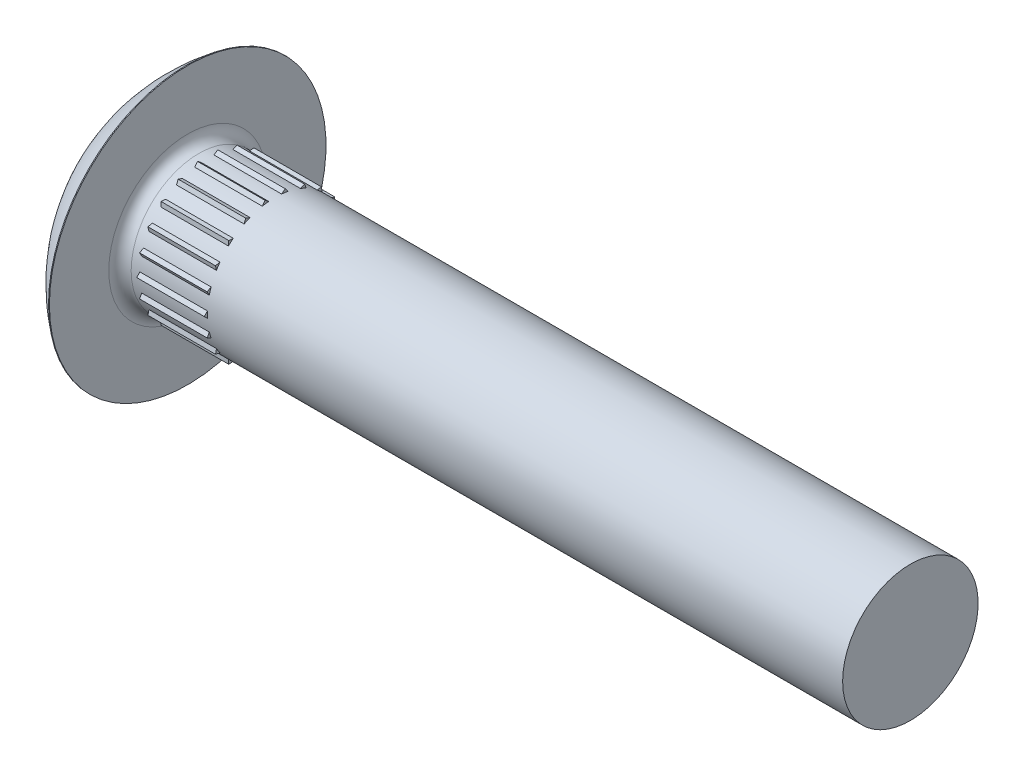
ISO-10303-21;
HEADER;
FILE_DESCRIPTION(('STEP AP214'),'2;1');
FILE_NAME('part.step','',(''),(''),'','','');
FILE_SCHEMA(('AUTOMOTIVE_DESIGN { 1 0 10303 214 1 1 1 1 }'));
ENDSEC;
DATA;
#1=APPLICATION_CONTEXT('core data for automotive mechanical design processes');
#2=APPLICATION_PROTOCOL_DEFINITION('international standard','automotive_design',2000,#1);
#3=PRODUCT_CONTEXT('',#1,'mechanical');
#4=PRODUCT('Part','Part','',(#3));
#5=PRODUCT_RELATED_PRODUCT_CATEGORY('part','',(#4));
#6=PRODUCT_DEFINITION_FORMATION('','',#4);
#7=PRODUCT_DEFINITION_CONTEXT('part definition',#1,'design');
#8=PRODUCT_DEFINITION('design','',#6,#7);
#9=PRODUCT_DEFINITION_SHAPE('','',#8);
#10=(LENGTH_UNIT() NAMED_UNIT(*) SI_UNIT(.MILLI.,.METRE.));
#11=(NAMED_UNIT(*) PLANE_ANGLE_UNIT() SI_UNIT($,.RADIAN.));
#12=(NAMED_UNIT(*) SI_UNIT($,.STERADIAN.) SOLID_ANGLE_UNIT());
#13=UNCERTAINTY_MEASURE_WITH_UNIT(LENGTH_MEASURE(1.E-05),#10,'distance_accuracy_value','');
#14=(GEOMETRIC_REPRESENTATION_CONTEXT(3) GLOBAL_UNCERTAINTY_ASSIGNED_CONTEXT((#13)) GLOBAL_UNIT_ASSIGNED_CONTEXT((#10,
#11,#12)) REPRESENTATION_CONTEXT('',''));
#15=CARTESIAN_POINT('',(0.,0.,0.));
#16=DIRECTION('',(0.,0.,1.));
#17=DIRECTION('',(1.,0.,0.));
#18=AXIS2_PLACEMENT_3D('',#15,#16,#17);
#19=CARTESIAN_POINT('',(0.,0.,0.));
#20=DIRECTION('',(-1.,0.,0.));
#21=DIRECTION('',(0.,0.,1.));
#22=AXIS2_PLACEMENT_3D('',#19,#20,#21);
#23=CYLINDRICAL_SURFACE('',#22,9.525);
#24=CARTESIAN_POINT('',(111.5314,0.,0.));
#25=DIRECTION('',(-1.,0.,0.));
#26=DIRECTION('',(0.,0.,1.));
#27=AXIS2_PLACEMENT_3D('',#24,#25,#26);
#28=CIRCLE('',#27,9.525);
#29=CARTESIAN_POINT('',(111.5314,0.,9.525));
#30=VERTEX_POINT('',#29);
#31=EDGE_CURVE('E1045',#30,#30,#28,.T.);
#32=ORIENTED_EDGE('',*,*,#31,.T.);
#33=EDGE_LOOP('',(#32));
#34=FACE_BOUND('',#33,.T.);
#35=CARTESIAN_POINT('',(11.5062,0.,0.));
#36=DIRECTION('',(-1.,0.,0.));
#37=DIRECTION('',(0.,0.,1.));
#38=AXIS2_PLACEMENT_3D('',#35,#36,#37);
#39=CIRCLE('',#38,9.525);
#40=CARTESIAN_POINT('',(11.5062,0.,9.525));
#41=VERTEX_POINT('',#40);
#42=EDGE_CURVE('E1040',#41,#41,#39,.T.);
#43=ORIENTED_EDGE('',*,*,#42,.F.);
#44=EDGE_LOOP('',(#43));
#45=FACE_BOUND('',#44,.T.);
#46=DIRECTION('',(-1.,0.,0.));
#47=VECTOR('',#46,1.);
#48=CARTESIAN_POINT('',(32.2360168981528,-0.455392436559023,9.51410756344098));
#49=LINE('',#48,#47);
#50=CARTESIAN_POINT('',(22.225,-0.455392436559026,9.51410756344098));
#51=VERTEX_POINT('',#50);
#52=CARTESIAN_POINT('',(12.7254,-0.455392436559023,9.51410756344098));
#53=VERTEX_POINT('',#52);
#54=EDGE_CURVE('E1008',#51,#53,#49,.T.);
#55=ORIENTED_EDGE('',*,*,#54,.T.);
#56=CARTESIAN_POINT('',(12.7254,0.,0.));
#57=DIRECTION('',(1.,0.,0.));
#58=DIRECTION('',(0.,0.,-1.));
#59=AXIS2_PLACEMENT_3D('',#56,#57,#58);
#60=CIRCLE('',#59,9.525);
#61=CARTESIAN_POINT('',(12.7254,0.455392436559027,9.51410756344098));
#62=VERTEX_POINT('',#61);
#63=EDGE_CURVE('E1052',#53,#62,#60,.F.);
#64=ORIENTED_EDGE('',*,*,#63,.T.);
#65=DIRECTION('',(-1.,0.,0.));
#66=VECTOR('',#65,1.);
#67=CARTESIAN_POINT('',(32.2360168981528,0.455392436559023,9.51410756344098));
#68=LINE('',#67,#66);
#69=CARTESIAN_POINT('',(22.225,0.455392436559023,9.51410756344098));
#70=VERTEX_POINT('',#69);
#71=EDGE_CURVE('E988',#70,#62,#68,.T.);
#72=ORIENTED_EDGE('',*,*,#71,.F.);
#73=CARTESIAN_POINT('',(22.225,0.,0.));
#74=DIRECTION('',(1.,0.,0.));
#75=DIRECTION('',(0.,0.,-1.));
#76=AXIS2_PLACEMENT_3D('',#73,#74,#75);
#77=CIRCLE('',#76,9.525);
#78=EDGE_CURVE('E1050',#51,#70,#77,.F.);
#79=ORIENTED_EDGE('',*,*,#78,.F.);
#80=EDGE_LOOP('',(#55,#64,#72,#79));
#81=FACE_BOUND('',#80,.T.);
#82=DIRECTION('',(-1.,0.,0.));
#83=VECTOR('',#82,1.);
#84=CARTESIAN_POINT('',(32.2858154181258,-3.11737969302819,9.00042048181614));
#85=LINE('',#84,#83);
#86=CARTESIAN_POINT('',(22.225,-3.11737969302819,9.00042048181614));
#87=VERTEX_POINT('',#86);
#88=CARTESIAN_POINT('',(12.7254,-3.11737969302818,9.00042048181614));
#89=VERTEX_POINT('',#88);
#90=EDGE_CURVE('E978',#87,#89,#85,.T.);
#91=ORIENTED_EDGE('',*,*,#90,.T.);
#92=CARTESIAN_POINT('',(12.7254,0.,0.));
#93=DIRECTION('',(1.,0.,0.));
#94=DIRECTION('',(0.,0.,-1.));
#95=AXIS2_PLACEMENT_3D('',#92,#93,#94);
#96=CIRCLE('',#95,9.525);
#97=CARTESIAN_POINT('',(12.7254,-2.24348800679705,9.25701823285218));
#98=VERTEX_POINT('',#97);
#99=EDGE_CURVE('E1057',#89,#98,#96,.F.);
#100=ORIENTED_EDGE('',*,*,#99,.T.);
#101=DIRECTION('',(-1.,0.,0.));
#102=VECTOR('',#101,1.);
#103=CARTESIAN_POINT('',(32.2858154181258,-2.24348800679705,9.25701823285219));
#104=LINE('',#103,#102);
#105=CARTESIAN_POINT('',(22.225,-2.24348800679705,9.25701823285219));
#106=VERTEX_POINT('',#105);
#107=EDGE_CURVE('E966',#106,#98,#104,.T.);
#108=ORIENTED_EDGE('',*,*,#107,.F.);
#109=CARTESIAN_POINT('',(22.225,0.,0.));
#110=DIRECTION('',(1.,0.,0.));
#111=DIRECTION('',(0.,0.,-1.));
#112=AXIS2_PLACEMENT_3D('',#109,#110,#111);
#113=CIRCLE('',#112,9.525);
#114=EDGE_CURVE('E1054',#87,#106,#113,.F.);
#115=ORIENTED_EDGE('',*,*,#114,.F.);
#116=EDGE_LOOP('',(#91,#100,#108,#115));
#117=FACE_BOUND('',#116,.T.);
#118=DIRECTION('',(-1.,0.,0.));
#119=VECTOR('',#118,1.);
#120=CARTESIAN_POINT('',(32.2691722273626,-5.5268153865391,7.75757286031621));
#121=LINE('',#120,#119);
#122=CARTESIAN_POINT('',(22.225,-5.5268153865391,7.75757286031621));
#123=VERTEX_POINT('',#122);
#124=CARTESIAN_POINT('',(12.7254,-5.5268153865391,7.75757286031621));
#125=VERTEX_POINT('',#124);
#126=EDGE_CURVE('E947',#123,#125,#121,.T.);
#127=ORIENTED_EDGE('',*,*,#126,.T.);
#128=CARTESIAN_POINT('',(12.7254,0.,0.));
#129=DIRECTION('',(1.,0.,0.));
#130=DIRECTION('',(0.,0.,-1.));
#131=AXIS2_PLACEMENT_3D('',#128,#129,#130);
#132=CIRCLE('',#131,9.525);
#133=CARTESIAN_POINT('',(12.7254,-4.76061439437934,8.24998033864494));
#134=VERTEX_POINT('',#133);
#135=EDGE_CURVE('E1063',#125,#134,#132,.F.);
#136=ORIENTED_EDGE('',*,*,#135,.T.);
#137=DIRECTION('',(-1.,0.,0.));
#138=VECTOR('',#137,1.);
#139=CARTESIAN_POINT('',(32.2691722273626,-4.76061439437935,8.24998033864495));
#140=LINE('',#139,#138);
#141=CARTESIAN_POINT('',(22.225,-4.76061439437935,8.24998033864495));
#142=VERTEX_POINT('',#141);
#143=EDGE_CURVE('E937',#142,#134,#140,.T.);
#144=ORIENTED_EDGE('',*,*,#143,.F.);
#145=CARTESIAN_POINT('',(22.225,0.,0.));
#146=DIRECTION('',(1.,0.,0.));
#147=DIRECTION('',(0.,0.,-1.));
#148=AXIS2_PLACEMENT_3D('',#145,#146,#147);
#149=CIRCLE('',#148,9.525);
#150=EDGE_CURVE('E1062',#123,#142,#149,.F.);
#151=ORIENTED_EDGE('',*,*,#150,.F.);
#152=EDGE_LOOP('',(#127,#136,#144,#151));
#153=FACE_BOUND('',#152,.T.);
#154=DIRECTION('',(-1.,0.,0.));
#155=VECTOR('',#154,1.);
#156=CARTESIAN_POINT('',(32.2246472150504,-7.48850136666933,5.8862528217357));
#157=LINE('',#156,#155);
#158=CARTESIAN_POINT('',(22.225,-7.48850136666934,5.8862528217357));
#159=VERTEX_POINT('',#158);
#160=CARTESIAN_POINT('',(12.7254,-7.48850136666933,5.8862528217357));
#161=VERTEX_POINT('',#160);
#162=EDGE_CURVE('E927',#159,#161,#157,.T.);
#163=ORIENTED_EDGE('',*,*,#162,.T.);
#164=CARTESIAN_POINT('',(12.7254,0.,0.));
#165=DIRECTION('',(1.,0.,0.));
#166=DIRECTION('',(0.,0.,-1.));
#167=AXIS2_PLACEMENT_3D('',#164,#165,#166);
#168=CIRCLE('',#167,9.525);
#169=CARTESIAN_POINT('',(12.7254,-6.89206411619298,6.57457810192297));
#170=VERTEX_POINT('',#169);
#171=EDGE_CURVE('E1072',#161,#170,#168,.F.);
#172=ORIENTED_EDGE('',*,*,#171,.T.);
#173=DIRECTION('',(-1.,0.,0.));
#174=VECTOR('',#173,1.);
#175=CARTESIAN_POINT('',(32.2246472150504,-6.89206411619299,6.57457810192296));
#176=LINE('',#175,#174);
#177=CARTESIAN_POINT('',(22.225,-6.89206411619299,6.57457810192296));
#178=VERTEX_POINT('',#177);
#179=EDGE_CURVE('E920',#178,#170,#176,.T.);
#180=ORIENTED_EDGE('',*,*,#179,.F.);
#181=CARTESIAN_POINT('',(22.225,0.,0.));
#182=DIRECTION('',(1.,0.,0.));
#183=DIRECTION('',(0.,0.,-1.));
#184=AXIS2_PLACEMENT_3D('',#181,#182,#183);
#185=CIRCLE('',#184,9.525);
#186=EDGE_CURVE('E1067',#159,#178,#185,.F.);
#187=ORIENTED_EDGE('',*,*,#186,.F.);
#188=EDGE_LOOP('',(#163,#172,#180,#187));
#189=FACE_BOUND('',#188,.T.);
#190=DIRECTION('',(-1.,0.,0.));
#191=VECTOR('',#190,1.);
#192=CARTESIAN_POINT('',(32.2900766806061,-8.84351350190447,3.53806358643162));
#193=LINE('',#192,#191);
#194=CARTESIAN_POINT('',(22.225,-8.84351350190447,3.53806358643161));
#195=VERTEX_POINT('',#194);
#196=CARTESIAN_POINT('',(12.7254,-8.84351350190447,3.53806358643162));
#197=VERTEX_POINT('',#196);
#198=EDGE_CURVE('E897',#195,#197,#193,.T.);
#199=ORIENTED_EDGE('',*,*,#198,.T.);
#200=CARTESIAN_POINT('',(12.7254,0.,0.));
#201=DIRECTION('',(1.,0.,0.));
#202=DIRECTION('',(0.,0.,-1.));
#203=AXIS2_PLACEMENT_3D('',#200,#201,#202);
#204=CIRCLE('',#203,9.525);
#205=CARTESIAN_POINT('',(12.7254,-8.46515979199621,4.3665426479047));
#206=VERTEX_POINT('',#205);
#207=EDGE_CURVE('E1079',#197,#206,#204,.F.);
#208=ORIENTED_EDGE('',*,*,#207,.T.);
#209=DIRECTION('',(-1.,0.,0.));
#210=VECTOR('',#209,1.);
#211=CARTESIAN_POINT('',(32.2900766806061,-8.46515979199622,4.3665426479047));
#212=LINE('',#211,#210);
#213=CARTESIAN_POINT('',(22.225,-8.46515979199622,4.3665426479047));
#214=VERTEX_POINT('',#213);
#215=EDGE_CURVE('E886',#214,#206,#212,.T.);
#216=ORIENTED_EDGE('',*,*,#215,.F.);
#217=CARTESIAN_POINT('',(22.225,0.,0.));
#218=DIRECTION('',(1.,0.,0.));
#219=DIRECTION('',(0.,0.,-1.));
#220=AXIS2_PLACEMENT_3D('',#217,#218,#219);
#221=CIRCLE('',#220,9.525);
#222=EDGE_CURVE('E1074',#195,#214,#221,.F.);
#223=ORIENTED_EDGE('',*,*,#222,.F.);
#224=EDGE_LOOP('',(#199,#208,#216,#223));
#225=FACE_BOUND('',#224,.T.);
#226=DIRECTION('',(-1.,0.,0.));
#227=VECTOR('',#226,1.);
#228=CARTESIAN_POINT('',(32.2567026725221,-9.48207676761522,0.903241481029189));
#229=LINE('',#228,#227);
#230=CARTESIAN_POINT('',(22.225,-9.48207676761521,0.903241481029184));
#231=VERTEX_POINT('',#230);
#232=CARTESIAN_POINT('',(12.7254,-9.48207676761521,0.903241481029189));
#233=VERTEX_POINT('',#232);
#234=EDGE_CURVE('E878',#231,#233,#229,.T.);
#235=ORIENTED_EDGE('',*,*,#234,.T.);
#236=CARTESIAN_POINT('',(12.7254,0.,0.));
#237=DIRECTION('',(1.,0.,0.));
#238=DIRECTION('',(0.,0.,-1.));
#239=AXIS2_PLACEMENT_3D('',#236,#237,#238);
#240=CIRCLE('',#239,9.525);
#241=CARTESIAN_POINT('',(12.7254,-9.35245856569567,1.80475587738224));
#242=VERTEX_POINT('',#241);
#243=EDGE_CURVE('E1086',#233,#242,#240,.F.);
#244=ORIENTED_EDGE('',*,*,#243,.T.);
#245=DIRECTION('',(-1.,0.,0.));
#246=VECTOR('',#245,1.);
#247=CARTESIAN_POINT('',(32.2567026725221,-9.35245856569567,1.80475587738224));
#248=LINE('',#247,#246);
#249=CARTESIAN_POINT('',(22.225,-9.35245856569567,1.80475587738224));
#250=VERTEX_POINT('',#249);
#251=EDGE_CURVE('E861',#250,#242,#248,.T.);
#252=ORIENTED_EDGE('',*,*,#251,.F.);
#253=CARTESIAN_POINT('',(22.225,0.,0.));
#254=DIRECTION('',(1.,0.,0.));
#255=DIRECTION('',(0.,0.,-1.));
#256=AXIS2_PLACEMENT_3D('',#253,#254,#255);
#257=CIRCLE('',#256,9.525);
#258=EDGE_CURVE('E1085',#231,#250,#257,.F.);
#259=ORIENTED_EDGE('',*,*,#258,.F.);
#260=EDGE_LOOP('',(#235,#244,#252,#259));
#261=FACE_BOUND('',#260,.T.);
#262=DIRECTION('',(-1.,0.,0.));
#263=VECTOR('',#262,1.);
#264=CARTESIAN_POINT('',(32.2567026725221,-9.35245856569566,-1.8047558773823));
#265=LINE('',#264,#263);
#266=CARTESIAN_POINT('',(22.225,-9.35245856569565,-1.8047558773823));
#267=VERTEX_POINT('',#266);
#268=CARTESIAN_POINT('',(12.7254,-9.35245856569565,-1.8047558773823));
#269=VERTEX_POINT('',#268);
#270=EDGE_CURVE('E847',#267,#269,#265,.T.);
#271=ORIENTED_EDGE('',*,*,#270,.T.);
#272=CARTESIAN_POINT('',(12.7254,0.,0.));
#273=DIRECTION('',(1.,0.,0.));
#274=DIRECTION('',(0.,0.,-1.));
#275=AXIS2_PLACEMENT_3D('',#272,#273,#274);
#276=CIRCLE('',#275,9.525);
#277=CARTESIAN_POINT('',(12.7254,-9.48207676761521,-0.903241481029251));
#278=VERTEX_POINT('',#277);
#279=EDGE_CURVE('E1092',#269,#278,#276,.F.);
#280=ORIENTED_EDGE('',*,*,#279,.T.);
#281=DIRECTION('',(-1.,0.,0.));
#282=VECTOR('',#281,1.);
#283=CARTESIAN_POINT('',(32.2567026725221,-9.48207676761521,-0.903241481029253));
#284=LINE('',#283,#282);
#285=CARTESIAN_POINT('',(22.225,-9.48207676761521,-0.903241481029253));
#286=VERTEX_POINT('',#285);
#287=EDGE_CURVE('E833',#286,#278,#284,.T.);
#288=ORIENTED_EDGE('',*,*,#287,.F.);
#289=CARTESIAN_POINT('',(22.225,0.,0.));
#290=DIRECTION('',(1.,0.,0.));
#291=DIRECTION('',(0.,0.,-1.));
#292=AXIS2_PLACEMENT_3D('',#289,#290,#291);
#293=CIRCLE('',#292,9.525);
#294=EDGE_CURVE('E1087',#267,#286,#293,.F.);
#295=ORIENTED_EDGE('',*,*,#294,.F.);
#296=EDGE_LOOP('',(#271,#280,#288,#295));
#297=FACE_BOUND('',#296,.T.);
#298=DIRECTION('',(-1.,0.,0.));
#299=VECTOR('',#298,1.);
#300=CARTESIAN_POINT('',(32.2900766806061,-8.46515979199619,-4.36654264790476));
#301=LINE('',#300,#299);
#302=CARTESIAN_POINT('',(22.225,-8.46515979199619,-4.36654264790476));
#303=VERTEX_POINT('',#302);
#304=CARTESIAN_POINT('',(12.7254,-8.46515979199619,-4.36654264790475));
#305=VERTEX_POINT('',#304);
#306=EDGE_CURVE('E822',#303,#305,#301,.T.);
#307=ORIENTED_EDGE('',*,*,#306,.T.);
#308=CARTESIAN_POINT('',(12.7254,0.,0.));
#309=DIRECTION('',(1.,0.,0.));
#310=DIRECTION('',(0.,0.,-1.));
#311=AXIS2_PLACEMENT_3D('',#308,#309,#310);
#312=CIRCLE('',#311,9.525);
#313=CARTESIAN_POINT('',(12.7254,-8.84351350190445,-3.53806358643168));
#314=VERTEX_POINT('',#313);
#315=EDGE_CURVE('E1098',#305,#314,#312,.F.);
#316=ORIENTED_EDGE('',*,*,#315,.T.);
#317=DIRECTION('',(-1.,0.,0.));
#318=VECTOR('',#317,1.);
#319=CARTESIAN_POINT('',(32.2900766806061,-8.84351350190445,-3.53806358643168));
#320=LINE('',#319,#318);
#321=CARTESIAN_POINT('',(22.225,-8.84351350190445,-3.53806358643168));
#322=VERTEX_POINT('',#321);
#323=EDGE_CURVE('E811',#322,#314,#320,.T.);
#324=ORIENTED_EDGE('',*,*,#323,.F.);
#325=CARTESIAN_POINT('',(22.225,0.,0.));
#326=DIRECTION('',(1.,0.,0.));
#327=DIRECTION('',(0.,0.,-1.));
#328=AXIS2_PLACEMENT_3D('',#325,#326,#327);
#329=CIRCLE('',#328,9.525);
#330=EDGE_CURVE('E1097',#303,#322,#329,.F.);
#331=ORIENTED_EDGE('',*,*,#330,.F.);
#332=EDGE_LOOP('',(#307,#316,#324,#331));
#333=FACE_BOUND('',#332,.T.);
#334=DIRECTION('',(-1.,0.,0.));
#335=VECTOR('',#334,1.);
#336=CARTESIAN_POINT('',(32.2246472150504,-6.89206411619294,-6.57457810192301));
#337=LINE('',#336,#335);
#338=CARTESIAN_POINT('',(22.225,-6.89206411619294,-6.57457810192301));
#339=VERTEX_POINT('',#338);
#340=CARTESIAN_POINT('',(12.7254,-6.89206411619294,-6.57457810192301));
#341=VERTEX_POINT('',#340);
#342=EDGE_CURVE('E794',#339,#341,#337,.T.);
#343=ORIENTED_EDGE('',*,*,#342,.T.);
#344=CARTESIAN_POINT('',(12.7254,0.,0.));
#345=DIRECTION('',(1.,0.,0.));
#346=DIRECTION('',(0.,0.,-1.));
#347=AXIS2_PLACEMENT_3D('',#344,#345,#346);
#348=CIRCLE('',#347,9.525);
#349=CARTESIAN_POINT('',(12.7254,-7.4885013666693,-5.88625282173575));
#350=VERTEX_POINT('',#349);
#351=EDGE_CURVE('E1109',#341,#350,#348,.F.);
#352=ORIENTED_EDGE('',*,*,#351,.T.);
#353=DIRECTION('',(-1.,0.,0.));
#354=VECTOR('',#353,1.);
#355=CARTESIAN_POINT('',(32.2246472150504,-7.48850136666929,-5.88625282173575));
#356=LINE('',#355,#354);
#357=CARTESIAN_POINT('',(22.225,-7.48850136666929,-5.88625282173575));
#358=VERTEX_POINT('',#357);
#359=EDGE_CURVE('E784',#358,#350,#356,.T.);
#360=ORIENTED_EDGE('',*,*,#359,.F.);
#361=CARTESIAN_POINT('',(22.225,0.,0.));
#362=DIRECTION('',(1.,0.,0.));
#363=DIRECTION('',(0.,0.,-1.));
#364=AXIS2_PLACEMENT_3D('',#361,#362,#363);
#365=CIRCLE('',#364,9.525);
#366=EDGE_CURVE('E1102',#339,#358,#365,.F.);
#367=ORIENTED_EDGE('',*,*,#366,.F.);
#368=EDGE_LOOP('',(#343,#352,#360,#367));
#369=FACE_BOUND('',#368,.T.);
#370=DIRECTION('',(-1.,0.,0.));
#371=VECTOR('',#370,1.);
#372=CARTESIAN_POINT('',(32.2691722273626,-4.76061439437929,-8.24998033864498));
#373=LINE('',#372,#371);
#374=CARTESIAN_POINT('',(22.225,-4.76061439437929,-8.24998033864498));
#375=VERTEX_POINT('',#374);
#376=CARTESIAN_POINT('',(12.7254,-4.76061439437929,-8.24998033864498));
#377=VERTEX_POINT('',#376);
#378=EDGE_CURVE('E775',#375,#377,#373,.T.);
#379=ORIENTED_EDGE('',*,*,#378,.T.);
#380=CARTESIAN_POINT('',(12.7254,0.,0.));
#381=DIRECTION('',(1.,0.,0.));
#382=DIRECTION('',(0.,0.,-1.));
#383=AXIS2_PLACEMENT_3D('',#380,#381,#382);
#384=CIRCLE('',#383,9.525);
#385=CARTESIAN_POINT('',(12.7254,-5.52681538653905,-7.75757286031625));
#386=VERTEX_POINT('',#385);
#387=EDGE_CURVE('E1113',#377,#386,#384,.F.);
#388=ORIENTED_EDGE('',*,*,#387,.T.);
#389=DIRECTION('',(-1.,0.,0.));
#390=VECTOR('',#389,1.);
#391=CARTESIAN_POINT('',(32.2691722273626,-5.52681538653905,-7.75757286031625));
#392=LINE('',#391,#390);
#393=CARTESIAN_POINT('',(22.225,-5.52681538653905,-7.75757286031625));
#394=VERTEX_POINT('',#393);
#395=EDGE_CURVE('E761',#394,#386,#392,.T.);
#396=ORIENTED_EDGE('',*,*,#395,.F.);
#397=CARTESIAN_POINT('',(22.225,0.,0.));
#398=DIRECTION('',(1.,0.,0.));
#399=DIRECTION('',(0.,0.,-1.));
#400=AXIS2_PLACEMENT_3D('',#397,#398,#399);
#401=CIRCLE('',#400,9.525);
#402=EDGE_CURVE('E1108',#375,#394,#401,.F.);
#403=ORIENTED_EDGE('',*,*,#402,.F.);
#404=EDGE_LOOP('',(#379,#388,#396,#403));
#405=FACE_BOUND('',#404,.T.);
#406=DIRECTION('',(-1.,0.,0.));
#407=VECTOR('',#406,1.);
#408=CARTESIAN_POINT('',(32.2858154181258,-2.24348800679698,-9.2570182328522));
#409=LINE('',#408,#407);
#410=CARTESIAN_POINT('',(22.225,-2.24348800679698,-9.2570182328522));
#411=VERTEX_POINT('',#410);
#412=CARTESIAN_POINT('',(12.7254,-2.24348800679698,-9.2570182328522));
#413=VERTEX_POINT('',#412);
#414=EDGE_CURVE('E745',#411,#413,#409,.T.);
#415=ORIENTED_EDGE('',*,*,#414,.T.);
#416=CARTESIAN_POINT('',(12.7254,0.,0.));
#417=DIRECTION('',(1.,0.,0.));
#418=DIRECTION('',(0.,0.,-1.));
#419=AXIS2_PLACEMENT_3D('',#416,#417,#418);
#420=CIRCLE('',#419,9.525);
#421=CARTESIAN_POINT('',(12.7254,-3.11737969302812,-9.00042048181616));
#422=VERTEX_POINT('',#421);
#423=EDGE_CURVE('E1123',#413,#422,#420,.F.);
#424=ORIENTED_EDGE('',*,*,#423,.T.);
#425=DIRECTION('',(-1.,0.,0.));
#426=VECTOR('',#425,1.);
#427=CARTESIAN_POINT('',(32.2858154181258,-3.11737969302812,-9.00042048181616));
#428=LINE('',#427,#426);
#429=CARTESIAN_POINT('',(22.225,-3.11737969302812,-9.00042048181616));
#430=VERTEX_POINT('',#429);
#431=EDGE_CURVE('E728',#430,#422,#428,.T.);
#432=ORIENTED_EDGE('',*,*,#431,.F.);
#433=CARTESIAN_POINT('',(22.225,0.,0.));
#434=DIRECTION('',(1.,0.,0.));
#435=DIRECTION('',(0.,0.,-1.));
#436=AXIS2_PLACEMENT_3D('',#433,#434,#435);
#437=CIRCLE('',#436,9.525);
#438=EDGE_CURVE('E1120',#411,#430,#437,.F.);
#439=ORIENTED_EDGE('',*,*,#438,.F.);
#440=EDGE_LOOP('',(#415,#424,#432,#439));
#441=FACE_BOUND('',#440,.T.);
#442=DIRECTION('',(-1.,0.,0.));
#443=VECTOR('',#442,1.);
#444=CARTESIAN_POINT('',(32.2360168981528,0.455392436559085,-9.51410756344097));
#445=LINE('',#444,#443);
#446=CARTESIAN_POINT('',(22.225,0.455392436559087,-9.51410756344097));
#447=VERTEX_POINT('',#446);
#448=CARTESIAN_POINT('',(12.7254,0.455392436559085,-9.51410756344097));
#449=VERTEX_POINT('',#448);
#450=EDGE_CURVE('E718',#447,#449,#445,.T.);
#451=ORIENTED_EDGE('',*,*,#450,.T.);
#452=CARTESIAN_POINT('',(12.7254,0.,0.));
#453=DIRECTION('',(1.,0.,0.));
#454=DIRECTION('',(0.,0.,-1.));
#455=AXIS2_PLACEMENT_3D('',#452,#453,#454);
#456=CIRCLE('',#455,9.525);
#457=CARTESIAN_POINT('',(12.7254,-0.455392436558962,-9.51410756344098));
#458=VERTEX_POINT('',#457);
#459=EDGE_CURVE('E1130',#449,#458,#456,.F.);
#460=ORIENTED_EDGE('',*,*,#459,.T.);
#461=DIRECTION('',(-1.,0.,0.));
#462=VECTOR('',#461,1.);
#463=CARTESIAN_POINT('',(32.2360168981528,-0.455392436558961,-9.51410756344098));
#464=LINE('',#463,#462);
#465=CARTESIAN_POINT('',(22.225,-0.455392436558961,-9.51410756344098));
#466=VERTEX_POINT('',#465);
#467=EDGE_CURVE('E706',#466,#458,#464,.T.);
#468=ORIENTED_EDGE('',*,*,#467,.F.);
#469=CARTESIAN_POINT('',(22.225,0.,0.));
#470=DIRECTION('',(1.,0.,0.));
#471=DIRECTION('',(0.,0.,-1.));
#472=AXIS2_PLACEMENT_3D('',#469,#470,#471);
#473=CIRCLE('',#472,9.525);
#474=EDGE_CURVE('E1125',#447,#466,#473,.F.);
#475=ORIENTED_EDGE('',*,*,#474,.F.);
#476=EDGE_LOOP('',(#451,#460,#468,#475));
#477=FACE_BOUND('',#476,.T.);
#478=DIRECTION('',(-1.,0.,0.));
#479=VECTOR('',#478,1.);
#480=CARTESIAN_POINT('',(32.2858154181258,3.11737969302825,-9.00042048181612));
#481=LINE('',#480,#479);
#482=CARTESIAN_POINT('',(22.225,3.11737969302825,-9.00042048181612));
#483=VERTEX_POINT('',#482);
#484=CARTESIAN_POINT('',(12.7254,3.11737969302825,-9.00042048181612));
#485=VERTEX_POINT('',#484);
#486=EDGE_CURVE('E687',#483,#485,#481,.T.);
#487=ORIENTED_EDGE('',*,*,#486,.T.);
#488=CARTESIAN_POINT('',(12.7254,0.,0.));
#489=DIRECTION('',(1.,0.,0.));
#490=DIRECTION('',(0.,0.,-1.));
#491=AXIS2_PLACEMENT_3D('',#488,#489,#490);
#492=CIRCLE('',#491,9.525);
#493=CARTESIAN_POINT('',(12.7254,2.24348800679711,-9.25701823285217));
#494=VERTEX_POINT('',#493);
#495=EDGE_CURVE('E1134',#485,#494,#492,.F.);
#496=ORIENTED_EDGE('',*,*,#495,.T.);
#497=DIRECTION('',(-1.,0.,0.));
#498=VECTOR('',#497,1.);
#499=CARTESIAN_POINT('',(32.2858154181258,2.24348800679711,-9.25701823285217));
#500=LINE('',#499,#498);
#501=CARTESIAN_POINT('',(22.225,2.24348800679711,-9.25701823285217));
#502=VERTEX_POINT('',#501);
#503=EDGE_CURVE('E677',#502,#494,#500,.T.);
#504=ORIENTED_EDGE('',*,*,#503,.F.);
#505=CARTESIAN_POINT('',(22.225,0.,0.));
#506=DIRECTION('',(1.,0.,0.));
#507=DIRECTION('',(0.,0.,-1.));
#508=AXIS2_PLACEMENT_3D('',#505,#506,#507);
#509=CIRCLE('',#508,9.525);
#510=EDGE_CURVE('E1131',#483,#502,#509,.F.);
#511=ORIENTED_EDGE('',*,*,#510,.F.);
#512=EDGE_LOOP('',(#487,#496,#504,#511));
#513=FACE_BOUND('',#512,.T.);
#514=DIRECTION('',(-1.,0.,0.));
#515=VECTOR('',#514,1.);
#516=CARTESIAN_POINT('',(32.2691722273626,5.52681538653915,-7.75757286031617));
#517=LINE('',#516,#515);
#518=CARTESIAN_POINT('',(22.225,5.52681538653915,-7.75757286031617));
#519=VERTEX_POINT('',#518);
#520=CARTESIAN_POINT('',(12.7254,5.52681538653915,-7.75757286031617));
#521=VERTEX_POINT('',#520);
#522=EDGE_CURVE('E667',#519,#521,#517,.T.);
#523=ORIENTED_EDGE('',*,*,#522,.T.);
#524=CARTESIAN_POINT('',(12.7254,0.,0.));
#525=DIRECTION('',(1.,0.,0.));
#526=DIRECTION('',(0.,0.,-1.));
#527=AXIS2_PLACEMENT_3D('',#524,#525,#526);
#528=CIRCLE('',#527,9.525);
#529=CARTESIAN_POINT('',(12.7254,4.7606143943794,-8.24998033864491));
#530=VERTEX_POINT('',#529);
#531=EDGE_CURVE('E1145',#521,#530,#528,.F.);
#532=ORIENTED_EDGE('',*,*,#531,.T.);
#533=DIRECTION('',(-1.,0.,0.));
#534=VECTOR('',#533,1.);
#535=CARTESIAN_POINT('',(32.2691722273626,4.7606143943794,-8.24998033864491));
#536=LINE('',#535,#534);
#537=CARTESIAN_POINT('',(22.225,4.7606143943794,-8.24998033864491));
#538=VERTEX_POINT('',#537);
#539=EDGE_CURVE('E660',#538,#530,#536,.T.);
#540=ORIENTED_EDGE('',*,*,#539,.F.);
#541=CARTESIAN_POINT('',(22.225,0.,0.));
#542=DIRECTION('',(1.,0.,0.));
#543=DIRECTION('',(0.,0.,-1.));
#544=AXIS2_PLACEMENT_3D('',#541,#542,#543);
#545=CIRCLE('',#544,9.525);
#546=EDGE_CURVE('E1136',#519,#538,#545,.F.);
#547=ORIENTED_EDGE('',*,*,#546,.F.);
#548=EDGE_LOOP('',(#523,#532,#540,#547));
#549=FACE_BOUND('',#548,.T.);
#550=DIRECTION('',(-1.,0.,0.));
#551=VECTOR('',#550,1.);
#552=CARTESIAN_POINT('',(32.2246472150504,7.48850136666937,-5.88625282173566));
#553=LINE('',#552,#551);
#554=CARTESIAN_POINT('',(22.225,7.48850136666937,-5.88625282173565));
#555=VERTEX_POINT('',#554);
#556=CARTESIAN_POINT('',(12.7254,7.48850136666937,-5.88625282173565));
#557=VERTEX_POINT('',#556);
#558=EDGE_CURVE('E637',#555,#557,#553,.T.);
#559=ORIENTED_EDGE('',*,*,#558,.T.);
#560=CARTESIAN_POINT('',(12.7254,0.,0.));
#561=DIRECTION('',(1.,0.,0.));
#562=DIRECTION('',(0.,0.,-1.));
#563=AXIS2_PLACEMENT_3D('',#560,#561,#562);
#564=CIRCLE('',#563,9.525);
#565=CARTESIAN_POINT('',(12.7254,6.89206411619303,-6.57457810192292));
#566=VERTEX_POINT('',#565);
#567=EDGE_CURVE('E1147',#557,#566,#564,.F.);
#568=ORIENTED_EDGE('',*,*,#567,.T.);
#569=DIRECTION('',(-1.,0.,0.));
#570=VECTOR('',#569,1.);
#571=CARTESIAN_POINT('',(32.2246472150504,6.89206411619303,-6.57457810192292));
#572=LINE('',#571,#570);
#573=CARTESIAN_POINT('',(22.225,6.89206411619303,-6.57457810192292));
#574=VERTEX_POINT('',#573);
#575=EDGE_CURVE('E626',#574,#566,#572,.T.);
#576=ORIENTED_EDGE('',*,*,#575,.F.);
#577=CARTESIAN_POINT('',(22.225,0.,0.));
#578=DIRECTION('',(1.,0.,0.));
#579=DIRECTION('',(0.,0.,-1.));
#580=AXIS2_PLACEMENT_3D('',#577,#578,#579);
#581=CIRCLE('',#580,9.525);
#582=EDGE_CURVE('E1142',#555,#574,#581,.F.);
#583=ORIENTED_EDGE('',*,*,#582,.F.);
#584=EDGE_LOOP('',(#559,#568,#576,#583));
#585=FACE_BOUND('',#584,.T.);
#586=DIRECTION('',(-1.,0.,0.));
#587=VECTOR('',#586,1.);
#588=CARTESIAN_POINT('',(32.2900766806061,8.84351350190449,-3.53806358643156));
#589=LINE('',#588,#587);
#590=CARTESIAN_POINT('',(22.225,8.84351350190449,-3.53806358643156));
#591=VERTEX_POINT('',#590);
#592=CARTESIAN_POINT('',(12.7254,8.84351350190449,-3.53806358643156));
#593=VERTEX_POINT('',#592);
#594=EDGE_CURVE('E618',#591,#593,#589,.T.);
#595=ORIENTED_EDGE('',*,*,#594,.T.);
#596=CARTESIAN_POINT('',(12.7254,0.,0.));
#597=DIRECTION('',(1.,0.,0.));
#598=DIRECTION('',(0.,0.,-1.));
#599=AXIS2_PLACEMENT_3D('',#596,#597,#598);
#600=CIRCLE('',#599,9.525);
#601=CARTESIAN_POINT('',(12.7254,8.46515979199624,-4.36654264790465));
#602=VERTEX_POINT('',#601);
#603=EDGE_CURVE('E1156',#593,#602,#600,.F.);
#604=ORIENTED_EDGE('',*,*,#603,.T.);
#605=DIRECTION('',(-1.,0.,0.));
#606=VECTOR('',#605,1.);
#607=CARTESIAN_POINT('',(32.2900766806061,8.46515979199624,-4.36654264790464));
#608=LINE('',#607,#606);
#609=CARTESIAN_POINT('',(22.225,8.46515979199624,-4.36654264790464));
#610=VERTEX_POINT('',#609);
#611=EDGE_CURVE('E601',#610,#602,#608,.T.);
#612=ORIENTED_EDGE('',*,*,#611,.F.);
#613=CARTESIAN_POINT('',(22.225,0.,0.));
#614=DIRECTION('',(1.,0.,0.));
#615=DIRECTION('',(0.,0.,-1.));
#616=AXIS2_PLACEMENT_3D('',#613,#614,#615);
#617=CIRCLE('',#616,9.525);
#618=EDGE_CURVE('E1155',#591,#610,#617,.F.);
#619=ORIENTED_EDGE('',*,*,#618,.F.);
#620=EDGE_LOOP('',(#595,#604,#612,#619));
#621=FACE_BOUND('',#620,.T.);
#622=DIRECTION('',(-1.,0.,0.));
#623=VECTOR('',#622,1.);
#624=CARTESIAN_POINT('',(32.2567026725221,9.48207676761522,-0.903241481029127));
#625=LINE('',#624,#623);
#626=CARTESIAN_POINT('',(22.225,9.48207676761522,-0.903241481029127));
#627=VERTEX_POINT('',#626);
#628=CARTESIAN_POINT('',(12.7254,9.48207676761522,-0.903241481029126));
#629=VERTEX_POINT('',#628);
#630=EDGE_CURVE('E587',#627,#629,#625,.T.);
#631=ORIENTED_EDGE('',*,*,#630,.T.);
#632=CARTESIAN_POINT('',(12.7254,0.,0.));
#633=DIRECTION('',(1.,0.,0.));
#634=DIRECTION('',(0.,0.,-1.));
#635=AXIS2_PLACEMENT_3D('',#632,#633,#634);
#636=CIRCLE('',#635,9.525);
#637=CARTESIAN_POINT('',(12.7254,9.35245856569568,-1.80475587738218));
#638=VERTEX_POINT('',#637);
#639=EDGE_CURVE('E1164',#629,#638,#636,.F.);
#640=ORIENTED_EDGE('',*,*,#639,.T.);
#641=DIRECTION('',(-1.,0.,0.));
#642=VECTOR('',#641,1.);
#643=CARTESIAN_POINT('',(32.2567026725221,9.35245856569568,-1.80475587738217));
#644=LINE('',#643,#642);
#645=CARTESIAN_POINT('',(22.225,9.35245856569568,-1.80475587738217));
#646=VERTEX_POINT('',#645);
#647=EDGE_CURVE('E573',#646,#638,#644,.T.);
#648=ORIENTED_EDGE('',*,*,#647,.F.);
#649=CARTESIAN_POINT('',(22.225,0.,0.));
#650=DIRECTION('',(1.,0.,0.));
#651=DIRECTION('',(0.,0.,-1.));
#652=AXIS2_PLACEMENT_3D('',#649,#650,#651);
#653=CIRCLE('',#652,9.525);
#654=EDGE_CURVE('E1158',#627,#646,#653,.F.);
#655=ORIENTED_EDGE('',*,*,#654,.F.);
#656=EDGE_LOOP('',(#631,#640,#648,#655));
#657=FACE_BOUND('',#656,.T.);
#658=DIRECTION('',(-1.,0.,0.));
#659=VECTOR('',#658,1.);
#660=CARTESIAN_POINT('',(32.2567026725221,9.35245856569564,1.80475587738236));
#661=LINE('',#660,#659);
#662=CARTESIAN_POINT('',(22.225,9.35245856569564,1.80475587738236));
#663=VERTEX_POINT('',#662);
#664=CARTESIAN_POINT('',(12.7254,9.35245856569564,1.80475587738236));
#665=VERTEX_POINT('',#664);
#666=EDGE_CURVE('E562',#663,#665,#661,.T.);
#667=ORIENTED_EDGE('',*,*,#666,.T.);
#668=CARTESIAN_POINT('',(12.7254,0.,0.));
#669=DIRECTION('',(1.,0.,0.));
#670=DIRECTION('',(0.,0.,-1.));
#671=AXIS2_PLACEMENT_3D('',#668,#669,#670);
#672=CIRCLE('',#671,9.525);
#673=CARTESIAN_POINT('',(12.7254,9.4820767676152,0.903241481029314));
#674=VERTEX_POINT('',#673);
#675=EDGE_CURVE('E1166',#665,#674,#672,.F.);
#676=ORIENTED_EDGE('',*,*,#675,.T.);
#677=DIRECTION('',(-1.,0.,0.));
#678=VECTOR('',#677,1.);
#679=CARTESIAN_POINT('',(32.2567026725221,9.4820767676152,0.903241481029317));
#680=LINE('',#679,#678);
#681=CARTESIAN_POINT('',(22.225,9.4820767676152,0.903241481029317));
#682=VERTEX_POINT('',#681);
#683=EDGE_CURVE('E551',#682,#674,#680,.T.);
#684=ORIENTED_EDGE('',*,*,#683,.F.);
#685=CARTESIAN_POINT('',(22.225,0.,0.));
#686=DIRECTION('',(1.,0.,0.));
#687=DIRECTION('',(0.,0.,-1.));
#688=AXIS2_PLACEMENT_3D('',#685,#686,#687);
#689=CIRCLE('',#688,9.525);
#690=EDGE_CURVE('E1168',#663,#682,#689,.F.);
#691=ORIENTED_EDGE('',*,*,#690,.F.);
#692=EDGE_LOOP('',(#667,#676,#684,#691));
#693=FACE_BOUND('',#692,.T.);
#694=DIRECTION('',(-1.,0.,0.));
#695=VECTOR('',#694,1.);
#696=CARTESIAN_POINT('',(32.2900766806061,8.46515979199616,4.36654264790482));
#697=LINE('',#696,#695);
#698=CARTESIAN_POINT('',(22.225,8.46515979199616,4.36654264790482));
#699=VERTEX_POINT('',#698);
#700=CARTESIAN_POINT('',(12.7254,8.46515979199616,4.36654264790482));
#701=VERTEX_POINT('',#700);
#702=EDGE_CURVE('E534',#699,#701,#697,.T.);
#703=ORIENTED_EDGE('',*,*,#702,.T.);
#704=CARTESIAN_POINT('',(12.7254,0.,0.));
#705=DIRECTION('',(1.,0.,0.));
#706=DIRECTION('',(0.,0.,-1.));
#707=AXIS2_PLACEMENT_3D('',#704,#705,#706);
#708=CIRCLE('',#707,9.525);
#709=CARTESIAN_POINT('',(12.7254,8.84351350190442,3.53806358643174));
#710=VERTEX_POINT('',#709);
#711=EDGE_CURVE('E1180',#701,#710,#708,.F.);
#712=ORIENTED_EDGE('',*,*,#711,.T.);
#713=DIRECTION('',(-1.,0.,0.));
#714=VECTOR('',#713,1.);
#715=CARTESIAN_POINT('',(32.2900766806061,8.84351350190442,3.53806358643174));
#716=LINE('',#715,#714);
#717=CARTESIAN_POINT('',(22.225,8.84351350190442,3.53806358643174));
#718=VERTEX_POINT('',#717);
#719=EDGE_CURVE('E524',#718,#710,#716,.T.);
#720=ORIENTED_EDGE('',*,*,#719,.F.);
#721=CARTESIAN_POINT('',(22.225,0.,0.));
#722=DIRECTION('',(1.,0.,0.));
#723=DIRECTION('',(0.,0.,-1.));
#724=AXIS2_PLACEMENT_3D('',#721,#722,#723);
#725=CIRCLE('',#724,9.525);
#726=EDGE_CURVE('E1175',#699,#718,#725,.F.);
#727=ORIENTED_EDGE('',*,*,#726,.F.);
#728=EDGE_LOOP('',(#703,#712,#720,#727));
#729=FACE_BOUND('',#728,.T.);
#730=DIRECTION('',(-1.,0.,0.));
#731=VECTOR('',#730,1.);
#732=CARTESIAN_POINT('',(32.2246472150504,6.8920641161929,6.57457810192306));
#733=LINE('',#732,#731);
#734=CARTESIAN_POINT('',(22.225,6.89206411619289,6.57457810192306));
#735=VERTEX_POINT('',#734);
#736=CARTESIAN_POINT('',(12.7254,6.8920641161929,6.57457810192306));
#737=VERTEX_POINT('',#736);
#738=EDGE_CURVE('E515',#735,#737,#733,.T.);
#739=ORIENTED_EDGE('',*,*,#738,.T.);
#740=CARTESIAN_POINT('',(12.7254,0.,0.));
#741=DIRECTION('',(1.,0.,0.));
#742=DIRECTION('',(0.,0.,-1.));
#743=AXIS2_PLACEMENT_3D('',#740,#741,#742);
#744=CIRCLE('',#743,9.525);
#745=CARTESIAN_POINT('',(12.7254,7.48850136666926,5.8862528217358));
#746=VERTEX_POINT('',#745);
#747=EDGE_CURVE('E1184',#737,#746,#744,.F.);
#748=ORIENTED_EDGE('',*,*,#747,.T.);
#749=DIRECTION('',(-1.,0.,0.));
#750=VECTOR('',#749,1.);
#751=CARTESIAN_POINT('',(32.2246472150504,7.48850136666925,5.88625282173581));
#752=LINE('',#751,#750);
#753=CARTESIAN_POINT('',(22.225,7.48850136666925,5.88625282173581));
#754=VERTEX_POINT('',#753);
#755=EDGE_CURVE('E501',#754,#746,#752,.T.);
#756=ORIENTED_EDGE('',*,*,#755,.F.);
#757=CARTESIAN_POINT('',(22.225,0.,0.));
#758=DIRECTION('',(1.,0.,0.));
#759=DIRECTION('',(0.,0.,-1.));
#760=AXIS2_PLACEMENT_3D('',#757,#758,#759);
#761=CIRCLE('',#760,9.525);
#762=EDGE_CURVE('E1179',#735,#754,#761,.F.);
#763=ORIENTED_EDGE('',*,*,#762,.F.);
#764=EDGE_LOOP('',(#739,#748,#756,#763));
#765=FACE_BOUND('',#764,.T.);
#766=DIRECTION('',(-1.,0.,0.));
#767=VECTOR('',#766,1.);
#768=CARTESIAN_POINT('',(32.2691722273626,4.76061439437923,8.24998033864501));
#769=LINE('',#768,#767);
#770=CARTESIAN_POINT('',(22.225,4.76061439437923,8.24998033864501));
#771=VERTEX_POINT('',#770);
#772=CARTESIAN_POINT('',(12.7254,4.76061439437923,8.24998033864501));
#773=VERTEX_POINT('',#772);
#774=EDGE_CURVE('E485',#771,#773,#769,.T.);
#775=ORIENTED_EDGE('',*,*,#774,.T.);
#776=CARTESIAN_POINT('',(12.7254,0.,0.));
#777=DIRECTION('',(1.,0.,0.));
#778=DIRECTION('',(0.,0.,-1.));
#779=AXIS2_PLACEMENT_3D('',#776,#777,#778);
#780=CIRCLE('',#779,9.525);
#781=CARTESIAN_POINT('',(12.7254,5.52681538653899,7.75757286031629));
#782=VERTEX_POINT('',#781);
#783=EDGE_CURVE('E463',#773,#782,#780,.F.);
#784=ORIENTED_EDGE('',*,*,#783,.T.);
#785=DIRECTION('',(-1.,0.,0.));
#786=VECTOR('',#785,1.);
#787=CARTESIAN_POINT('',(32.2691722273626,5.526815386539,7.75757286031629));
#788=LINE('',#787,#786);
#789=CARTESIAN_POINT('',(22.225,5.526815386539,7.75757286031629));
#790=VERTEX_POINT('',#789);
#791=EDGE_CURVE('E472',#790,#782,#788,.T.);
#792=ORIENTED_EDGE('',*,*,#791,.F.);
#793=CARTESIAN_POINT('',(22.225,0.,0.));
#794=DIRECTION('',(1.,0.,0.));
#795=DIRECTION('',(0.,0.,-1.));
#796=AXIS2_PLACEMENT_3D('',#793,#794,#795);
#797=CIRCLE('',#796,9.525);
#798=EDGE_CURVE('E1189',#771,#790,#797,.F.);
#799=ORIENTED_EDGE('',*,*,#798,.F.);
#800=EDGE_LOOP('',(#775,#784,#792,#799));
#801=FACE_BOUND('',#800,.T.);
#802=DIRECTION('',(-1.,0.,0.));
#803=VECTOR('',#802,1.);
#804=CARTESIAN_POINT('',(32.2858154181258,2.24348800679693,9.25701823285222));
#805=LINE('',#804,#803);
#806=CARTESIAN_POINT('',(22.225,2.24348800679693,9.25701823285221));
#807=VERTEX_POINT('',#806);
#808=CARTESIAN_POINT('',(12.7254,2.24348800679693,9.25701823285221));
#809=VERTEX_POINT('',#808);
#810=EDGE_CURVE('E58',#807,#809,#805,.T.);
#811=ORIENTED_EDGE('',*,*,#810,.T.);
#812=CARTESIAN_POINT('',(12.7254,0.,0.));
#813=DIRECTION('',(1.,0.,0.));
#814=DIRECTION('',(0.,0.,-1.));
#815=AXIS2_PLACEMENT_3D('',#812,#813,#814);
#816=CIRCLE('',#815,9.525);
#817=CARTESIAN_POINT('',(12.7254,3.11737969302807,9.00042048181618));
#818=VERTEX_POINT('',#817);
#819=EDGE_CURVE('E11',#809,#818,#816,.F.);
#820=ORIENTED_EDGE('',*,*,#819,.T.);
#821=DIRECTION('',(-1.,0.,0.));
#822=VECTOR('',#821,1.);
#823=CARTESIAN_POINT('',(32.2858154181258,3.11737969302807,9.00042048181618));
#824=LINE('',#823,#822);
#825=CARTESIAN_POINT('',(22.225,3.11737969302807,9.00042048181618));
#826=VERTEX_POINT('',#825);
#827=EDGE_CURVE('E449',#826,#818,#824,.T.);
#828=ORIENTED_EDGE('',*,*,#827,.F.);
#829=CARTESIAN_POINT('',(22.225,0.,0.));
#830=DIRECTION('',(1.,0.,0.));
#831=DIRECTION('',(0.,0.,-1.));
#832=AXIS2_PLACEMENT_3D('',#829,#830,#831);
#833=CIRCLE('',#832,9.525);
#834=EDGE_CURVE('E49',#807,#826,#833,.F.);
#835=ORIENTED_EDGE('',*,*,#834,.F.);
#836=EDGE_LOOP('',(#811,#820,#828,#835));
#837=FACE_BOUND('',#836,.T.);
#838=ADVANCED_FACE('F41',(#34,#45,#81,#117,#153,#189,#225,#261,#297,#333,#369,#405,#441,#477,
#513,#549,#585,#621,#657,#693,#729,#765,#801,#837),#23,.T.);
#839=CARTESIAN_POINT('',(24.1821900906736,0.,0.));
#840=DIRECTION('',(-1.,0.,0.));
#841=DIRECTION('',(0.,1.,0.));
#842=AXIS2_PLACEMENT_3D('',#839,#840,#841);
#843=SPHERICAL_SURFACE('',#842,24.1821900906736);
#844=CARTESIAN_POINT('',(9.8044,0.,0.));
#845=DIRECTION('',(-1.,0.,0.));
#846=DIRECTION('',(0.,0.,1.));
#847=AXIS2_PLACEMENT_3D('',#844,#845,#846);
#848=CIRCLE('',#847,19.4437);
#849=CARTESIAN_POINT('',(9.8044,0.,19.4437));
#850=VERTEX_POINT('',#849);
#851=EDGE_CURVE('E1016',#850,#850,#848,.T.);
#852=ORIENTED_EDGE('',*,*,#851,.T.);
#853=EDGE_LOOP('',(#852));
#854=FACE_BOUND('',#853,.T.);
#855=ADVANCED_FACE('F43',(#854),#843,.T.);
#856=CARTESIAN_POINT('',(111.5314,9.525,0.));
#857=DIRECTION('',(1.,0.,0.));
#858=DIRECTION('',(0.,0.,-1.));
#859=AXIS2_PLACEMENT_3D('',#856,#857,#858);
#860=PLANE('',#859);
#861=ORIENTED_EDGE('',*,*,#31,.F.);
#862=EDGE_LOOP('',(#861));
#863=FACE_BOUND('',#862,.T.);
#864=ADVANCED_FACE('F1227',(#863),#860,.T.);
#865=CARTESIAN_POINT('',(11.5062,0.,0.));
#866=DIRECTION('',(-1.,0.,0.));
#867=DIRECTION('',(0.,0.,1.));
#868=AXIS2_PLACEMENT_3D('',#865,#866,#867);
#869=TOROIDAL_SURFACE('',#868,11.0998,1.5748);
#870=CARTESIAN_POINT('',(9.9314,0.,0.));
#871=DIRECTION('',(-1.,0.,0.));
#872=DIRECTION('',(0.,0.,1.));
#873=AXIS2_PLACEMENT_3D('',#870,#871,#872);
#874=CIRCLE('',#873,11.0998);
#875=CARTESIAN_POINT('',(9.9314,0.,11.0998));
#876=VERTEX_POINT('',#875);
#877=EDGE_CURVE('E1033',#876,#876,#874,.T.);
#878=ORIENTED_EDGE('',*,*,#877,.F.);
#879=EDGE_LOOP('',(#878));
#880=FACE_BOUND('',#879,.T.);
#881=ORIENTED_EDGE('',*,*,#42,.T.);
#882=EDGE_LOOP('',(#881));
#883=FACE_BOUND('',#882,.T.);
#884=ADVANCED_FACE('F1228',(#880,#883),#869,.F.);
#885=CARTESIAN_POINT('',(9.9314,19.4437,0.));
#886=DIRECTION('',(1.,0.,0.));
#887=DIRECTION('',(0.,0.,-1.));
#888=AXIS2_PLACEMENT_3D('',#885,#886,#887);
#889=PLANE('',#888);
#890=ORIENTED_EDGE('',*,*,#877,.T.);
#891=EDGE_LOOP('',(#890));
#892=FACE_BOUND('',#891,.T.);
#893=CARTESIAN_POINT('',(9.9314,0.,0.));
#894=DIRECTION('',(-1.,0.,0.));
#895=DIRECTION('',(0.,0.,1.));
#896=AXIS2_PLACEMENT_3D('',#893,#894,#895);
#897=CIRCLE('',#896,19.4437);
#898=CARTESIAN_POINT('',(9.9314,0.,19.4437));
#899=VERTEX_POINT('',#898);
#900=EDGE_CURVE('E1032',#899,#899,#897,.T.);
#901=ORIENTED_EDGE('',*,*,#900,.F.);
#902=EDGE_LOOP('',(#901));
#903=FACE_BOUND('',#902,.T.);
#904=ADVANCED_FACE('F1239',(#892,#903),#889,.T.);
#905=CARTESIAN_POINT('',(0.,0.,0.));
#906=DIRECTION('',(-1.,0.,0.));
#907=DIRECTION('',(0.,0.,1.));
#908=AXIS2_PLACEMENT_3D('',#905,#906,#907);
#909=CYLINDRICAL_SURFACE('',#908,19.4437);
#910=ORIENTED_EDGE('',*,*,#851,.F.);
#911=EDGE_LOOP('',(#910));
#912=FACE_BOUND('',#911,.T.);
#913=ORIENTED_EDGE('',*,*,#900,.T.);
#914=EDGE_LOOP('',(#913));
#915=FACE_BOUND('',#914,.T.);
#916=ADVANCED_FACE('F1242',(#912,#915),#909,.T.);
#917=CARTESIAN_POINT('',(32.2360168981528,0.,9.9695));
#918=DIRECTION('',(0.,-0.707106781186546,-0.707106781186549));
#919=DIRECTION('',(0.,0.707106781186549,-0.707106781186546));
#920=AXIS2_PLACEMENT_3D('',#917,#918,#919);
#921=PLANE('',#920);
#922=DIRECTION('',(0.,-0.707106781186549,0.707106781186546));
#923=VECTOR('',#922,1.);
#924=CARTESIAN_POINT('',(22.225,0.,9.9695));
#925=LINE('',#924,#923);
#926=CARTESIAN_POINT('',(22.225,0.,9.9695));
#927=VERTEX_POINT('',#926);
#928=EDGE_CURVE('E1020',#70,#927,#925,.T.);
#929=ORIENTED_EDGE('',*,*,#928,.F.);
#930=ORIENTED_EDGE('',*,*,#71,.T.);
#931=DIRECTION('',(0.,-0.707106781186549,0.707106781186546));
#932=VECTOR('',#931,1.);
#933=CARTESIAN_POINT('',(12.7254,0.,9.9695));
#934=LINE('',#933,#932);
#935=CARTESIAN_POINT('',(12.7254,0.,9.9695));
#936=VERTEX_POINT('',#935);
#937=EDGE_CURVE('E1006',#62,#936,#934,.T.);
#938=ORIENTED_EDGE('',*,*,#937,.T.);
#939=DIRECTION('',(-1.,0.,0.));
#940=VECTOR('',#939,1.);
#941=CARTESIAN_POINT('',(32.2360168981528,0.,9.9695));
#942=LINE('',#941,#940);
#943=EDGE_CURVE('E1007',#927,#936,#942,.T.);
#944=ORIENTED_EDGE('',*,*,#943,.F.);
#945=EDGE_LOOP('',(#929,#930,#938,#944));
#946=FACE_BOUND('',#945,.T.);
#947=ADVANCED_FACE('F1621',(#946),#921,.F.);
#948=CARTESIAN_POINT('',(32.2360168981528,0.,9.9695));
#949=DIRECTION('',(0.,0.707106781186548,-0.707106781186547));
#950=DIRECTION('',(0.,0.707106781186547,0.707106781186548));
#951=AXIS2_PLACEMENT_3D('',#948,#949,#950);
#952=PLANE('',#951);
#953=DIRECTION('',(0.,-0.707106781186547,-0.707106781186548));
#954=VECTOR('',#953,1.);
#955=CARTESIAN_POINT('',(22.225,0.,9.9695));
#956=LINE('',#955,#954);
#957=EDGE_CURVE('E1015',#927,#51,#956,.T.);
#958=ORIENTED_EDGE('',*,*,#957,.F.);
#959=ORIENTED_EDGE('',*,*,#943,.T.);
#960=DIRECTION('',(0.,-0.707106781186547,-0.707106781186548));
#961=VECTOR('',#960,1.);
#962=CARTESIAN_POINT('',(12.7254,0.,9.9695));
#963=LINE('',#962,#961);
#964=EDGE_CURVE('E1005',#936,#53,#963,.T.);
#965=ORIENTED_EDGE('',*,*,#964,.T.);
#966=ORIENTED_EDGE('',*,*,#54,.F.);
#967=EDGE_LOOP('',(#958,#959,#965,#966));
#968=FACE_BOUND('',#967,.T.);
#969=ADVANCED_FACE('F1623',(#968),#952,.F.);
#970=CARTESIAN_POINT('',(12.7254,0.455392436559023,9.51410756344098));
#971=DIRECTION('',(1.,0.,0.));
#972=DIRECTION('',(0.,0.,-1.));
#973=AXIS2_PLACEMENT_3D('',#970,#971,#972);
#974=PLANE('',#973);
#975=ORIENTED_EDGE('',*,*,#63,.F.);
#976=ORIENTED_EDGE('',*,*,#964,.F.);
#977=ORIENTED_EDGE('',*,*,#937,.F.);
#978=EDGE_LOOP('',(#975,#976,#977));
#979=FACE_BOUND('',#978,.T.);
#980=ADVANCED_FACE('F1619',(#979),#974,.F.);
#981=CARTESIAN_POINT('',(22.225,0.,0.));
#982=DIRECTION('',(1.,0.,0.));
#983=DIRECTION('',(0.,0.,-1.));
#984=AXIS2_PLACEMENT_3D('',#981,#982,#983);
#985=PLANE('',#984);
#986=ORIENTED_EDGE('',*,*,#957,.T.);
#987=ORIENTED_EDGE('',*,*,#78,.T.);
#988=ORIENTED_EDGE('',*,*,#928,.T.);
#989=EDGE_LOOP('',(#986,#987,#988));
#990=FACE_BOUND('',#989,.T.);
#991=ADVANCED_FACE('F1612',(#990),#985,.T.);
#992=CARTESIAN_POINT('',(32.2858154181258,-2.80873272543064,9.56566520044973));
#993=DIRECTION('',(0.,-0.479248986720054,-0.877678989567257));
#994=DIRECTION('',(0.,0.877678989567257,-0.479248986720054));
#995=AXIS2_PLACEMENT_3D('',#992,#993,#994);
#996=PLANE('',#995);
#997=DIRECTION('',(0.,-0.877678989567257,0.479248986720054));
#998=VECTOR('',#997,1.);
#999=CARTESIAN_POINT('',(22.225,-2.80873272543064,9.56566520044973));
#1000=LINE('',#999,#998);
#1001=CARTESIAN_POINT('',(22.225,-2.80873272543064,9.56566520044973));
#1002=VERTEX_POINT('',#1001);
#1003=EDGE_CURVE('E993',#106,#1002,#1000,.T.);
#1004=ORIENTED_EDGE('',*,*,#1003,.F.);
#1005=ORIENTED_EDGE('',*,*,#107,.T.);
#1006=DIRECTION('',(0.,-0.877678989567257,0.479248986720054));
#1007=VECTOR('',#1006,1.);
#1008=CARTESIAN_POINT('',(12.7254,-2.80873272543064,9.56566520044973));
#1009=LINE('',#1008,#1007);
#1010=CARTESIAN_POINT('',(12.7254,-2.80873272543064,9.56566520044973));
#1011=VERTEX_POINT('',#1010);
#1012=EDGE_CURVE('E985',#98,#1011,#1009,.T.);
#1013=ORIENTED_EDGE('',*,*,#1012,.T.);
#1014=DIRECTION('',(-1.,0.,0.));
#1015=VECTOR('',#1014,1.);
#1016=CARTESIAN_POINT('',(32.2858154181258,-2.80873272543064,9.56566520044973));
#1017=LINE('',#1016,#1015);
#1018=EDGE_CURVE('E981',#1002,#1011,#1017,.T.);
#1019=ORIENTED_EDGE('',*,*,#1018,.F.);
#1020=EDGE_LOOP('',(#1004,#1005,#1013,#1019));
#1021=FACE_BOUND('',#1020,.T.);
#1022=ADVANCED_FACE('F1609',(#1021),#996,.F.);
#1023=CARTESIAN_POINT('',(32.2858154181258,-2.80873272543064,9.56566520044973));
#1024=DIRECTION('',(0.,0.877678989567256,-0.479248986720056));
#1025=DIRECTION('',(0.,0.479248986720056,0.877678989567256));
#1026=AXIS2_PLACEMENT_3D('',#1023,#1024,#1025);
#1027=PLANE('',#1026);
#1028=DIRECTION('',(0.,-0.479248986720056,-0.877678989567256));
#1029=VECTOR('',#1028,1.);
#1030=CARTESIAN_POINT('',(22.225,-2.80873272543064,9.56566520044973));
#1031=LINE('',#1030,#1029);
#1032=EDGE_CURVE('E987',#1002,#87,#1031,.T.);
#1033=ORIENTED_EDGE('',*,*,#1032,.F.);
#1034=ORIENTED_EDGE('',*,*,#1018,.T.);
#1035=DIRECTION('',(0.,-0.479248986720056,-0.877678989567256));
#1036=VECTOR('',#1035,1.);
#1037=CARTESIAN_POINT('',(12.7254,-2.80873272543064,9.56566520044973));
#1038=LINE('',#1037,#1036);
#1039=EDGE_CURVE('E977',#1011,#89,#1038,.T.);
#1040=ORIENTED_EDGE('',*,*,#1039,.T.);
#1041=ORIENTED_EDGE('',*,*,#90,.F.);
#1042=EDGE_LOOP('',(#1033,#1034,#1040,#1041));
#1043=FACE_BOUND('',#1042,.T.);
#1044=ADVANCED_FACE('F1606',(#1043),#1027,.F.);
#1045=CARTESIAN_POINT('',(12.7254,-2.24348800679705,9.25701823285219));
#1046=DIRECTION('',(1.,0.,0.));
#1047=DIRECTION('',(0.,0.28173255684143,-0.959492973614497));
#1048=AXIS2_PLACEMENT_3D('',#1045,#1046,#1047);
#1049=PLANE('',#1048);
#1050=ORIENTED_EDGE('',*,*,#99,.F.);
#1051=ORIENTED_EDGE('',*,*,#1039,.F.);
#1052=ORIENTED_EDGE('',*,*,#1012,.F.);
#1053=EDGE_LOOP('',(#1050,#1051,#1052));
#1054=FACE_BOUND('',#1053,.T.);
#1055=ADVANCED_FACE('F1603',(#1054),#1049,.F.);
#1056=CARTESIAN_POINT('',(22.225,0.,0.));
#1057=DIRECTION('',(1.,0.,0.));
#1058=DIRECTION('',(0.,0.,-1.));
#1059=AXIS2_PLACEMENT_3D('',#1056,#1057,#1058);
#1060=PLANE('',#1059);
#1061=ORIENTED_EDGE('',*,*,#1032,.T.);
#1062=ORIENTED_EDGE('',*,*,#114,.T.);
#1063=ORIENTED_EDGE('',*,*,#1003,.T.);
#1064=EDGE_LOOP('',(#1061,#1062,#1063));
#1065=FACE_BOUND('',#1064,.T.);
#1066=ADVANCED_FACE('F1594',(#1065),#1060,.T.);
#1067=CARTESIAN_POINT('',(32.2691722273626,-5.38991862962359,8.38687709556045));
#1068=DIRECTION('',(0.,-0.212565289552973,-0.97714686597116));
#1069=DIRECTION('',(0.,0.97714686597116,-0.212565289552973));
#1070=AXIS2_PLACEMENT_3D('',#1067,#1068,#1069);
#1071=PLANE('',#1070);
#1072=DIRECTION('',(0.,-0.97714686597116,0.212565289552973));
#1073=VECTOR('',#1072,1.);
#1074=CARTESIAN_POINT('',(22.225,-5.38991862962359,8.38687709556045));
#1075=LINE('',#1074,#1073);
#1076=CARTESIAN_POINT('',(22.225,-5.38991862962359,8.38687709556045));
#1077=VERTEX_POINT('',#1076);
#1078=EDGE_CURVE('E953',#142,#1077,#1075,.T.);
#1079=ORIENTED_EDGE('',*,*,#1078,.F.);
#1080=ORIENTED_EDGE('',*,*,#143,.T.);
#1081=DIRECTION('',(0.,-0.97714686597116,0.212565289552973));
#1082=VECTOR('',#1081,1.);
#1083=CARTESIAN_POINT('',(12.7254,-5.38991862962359,8.38687709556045));
#1084=LINE('',#1083,#1082);
#1085=CARTESIAN_POINT('',(12.7254,-5.38991862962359,8.38687709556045));
#1086=VERTEX_POINT('',#1085);
#1087=EDGE_CURVE('E958',#134,#1086,#1084,.T.);
#1088=ORIENTED_EDGE('',*,*,#1087,.T.);
#1089=DIRECTION('',(-1.,0.,0.));
#1090=VECTOR('',#1089,1.);
#1091=CARTESIAN_POINT('',(32.2691722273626,-5.38991862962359,8.38687709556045));
#1092=LINE('',#1091,#1090);
#1093=EDGE_CURVE('E954',#1077,#1086,#1092,.T.);
#1094=ORIENTED_EDGE('',*,*,#1093,.F.);
#1095=EDGE_LOOP('',(#1079,#1080,#1088,#1094));
#1096=FACE_BOUND('',#1095,.T.);
#1097=ADVANCED_FACE('F1593',(#1096),#1071,.F.);
#1098=CARTESIAN_POINT('',(32.2691722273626,-5.38991862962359,8.38687709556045));
#1099=DIRECTION('',(0.,0.97714686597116,-0.212565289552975));
#1100=DIRECTION('',(0.,0.212565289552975,0.97714686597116));
#1101=AXIS2_PLACEMENT_3D('',#1098,#1099,#1100);
#1102=PLANE('',#1101);
#1103=DIRECTION('',(0.,-0.212565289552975,-0.97714686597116));
#1104=VECTOR('',#1103,1.);
#1105=CARTESIAN_POINT('',(22.225,-5.38991862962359,8.38687709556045));
#1106=LINE('',#1105,#1104);
#1107=EDGE_CURVE('E964',#1077,#123,#1106,.T.);
#1108=ORIENTED_EDGE('',*,*,#1107,.F.);
#1109=ORIENTED_EDGE('',*,*,#1093,.T.);
#1110=DIRECTION('',(0.,-0.212565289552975,-0.97714686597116));
#1111=VECTOR('',#1110,1.);
#1112=CARTESIAN_POINT('',(12.7254,-5.38991862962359,8.38687709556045));
#1113=LINE('',#1112,#1111);
#1114=EDGE_CURVE('E952',#1086,#125,#1113,.T.);
#1115=ORIENTED_EDGE('',*,*,#1114,.T.);
#1116=ORIENTED_EDGE('',*,*,#126,.F.);
#1117=EDGE_LOOP('',(#1108,#1109,#1115,#1116));
#1118=FACE_BOUND('',#1117,.T.);
#1119=ADVANCED_FACE('F1595',(#1118),#1102,.F.);
#1120=CARTESIAN_POINT('',(12.7254,-4.76061439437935,8.24998033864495));
#1121=DIRECTION('',(1.,0.,0.));
#1122=DIRECTION('',(0.,0.540640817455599,-0.841253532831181));
#1123=AXIS2_PLACEMENT_3D('',#1120,#1121,#1122);
#1124=PLANE('',#1123);
#1125=ORIENTED_EDGE('',*,*,#135,.F.);
#1126=ORIENTED_EDGE('',*,*,#1114,.F.);
#1127=ORIENTED_EDGE('',*,*,#1087,.F.);
#1128=EDGE_LOOP('',(#1125,#1126,#1127));
#1129=FACE_BOUND('',#1128,.T.);
#1130=ADVANCED_FACE('F1588',(#1129),#1124,.F.);
#1131=CARTESIAN_POINT('',(22.225,0.,0.));
#1132=DIRECTION('',(1.,0.,0.));
#1133=DIRECTION('',(0.,0.,-1.));
#1134=AXIS2_PLACEMENT_3D('',#1131,#1132,#1133);
#1135=PLANE('',#1134);
#1136=ORIENTED_EDGE('',*,*,#1107,.T.);
#1137=ORIENTED_EDGE('',*,*,#150,.T.);
#1138=ORIENTED_EDGE('',*,*,#1078,.T.);
#1139=EDGE_LOOP('',(#1136,#1137,#1138));
#1140=FACE_BOUND('',#1139,.T.);
#1141=ADVANCED_FACE('F1584',(#1140),#1135,.T.);
#1142=CARTESIAN_POINT('',(32.2246472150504,-7.53444538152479,6.52863408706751));
#1143=DIRECTION('',(0.,0.0713391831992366,-0.997452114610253));
#1144=DIRECTION('',(0.,0.997452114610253,0.0713391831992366));
#1145=AXIS2_PLACEMENT_3D('',#1142,#1143,#1144);
#1146=PLANE('',#1145);
#1147=DIRECTION('',(0.,-0.997452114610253,-0.0713391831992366));
#1148=VECTOR('',#1147,1.);
#1149=CARTESIAN_POINT('',(22.225,-7.53444538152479,6.52863408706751));
#1150=LINE('',#1149,#1148);
#1151=CARTESIAN_POINT('',(22.225,-7.53444538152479,6.52863408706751));
#1152=VERTEX_POINT('',#1151);
#1153=EDGE_CURVE('E938',#178,#1152,#1150,.T.);
#1154=ORIENTED_EDGE('',*,*,#1153,.F.);
#1155=ORIENTED_EDGE('',*,*,#179,.T.);
#1156=DIRECTION('',(0.,-0.997452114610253,-0.0713391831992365));
#1157=VECTOR('',#1156,1.);
#1158=CARTESIAN_POINT('',(12.7254,-7.53444538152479,6.52863408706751));
#1159=LINE('',#1158,#1157);
#1160=CARTESIAN_POINT('',(12.7254,-7.53444538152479,6.52863408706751));
#1161=VERTEX_POINT('',#1160);
#1162=EDGE_CURVE('E926',#170,#1161,#1159,.T.);
#1163=ORIENTED_EDGE('',*,*,#1162,.T.);
#1164=DIRECTION('',(-1.,0.,0.));
#1165=VECTOR('',#1164,1.);
#1166=CARTESIAN_POINT('',(32.2246472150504,-7.53444538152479,6.52863408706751));
#1167=LINE('',#1166,#1165);
#1168=EDGE_CURVE('E930',#1152,#1161,#1167,.T.);
#1169=ORIENTED_EDGE('',*,*,#1168,.F.);
#1170=EDGE_LOOP('',(#1154,#1155,#1163,#1169));
#1171=FACE_BOUND('',#1170,.T.);
#1172=ADVANCED_FACE('F1577',(#1171),#1146,.F.);
#1173=CARTESIAN_POINT('',(32.2246472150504,-7.53444538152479,6.52863408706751));
#1174=DIRECTION('',(0.,0.997452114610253,0.0713391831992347));
#1175=DIRECTION('',(0.,-0.0713391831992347,0.997452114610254));
#1176=AXIS2_PLACEMENT_3D('',#1173,#1174,#1175);
#1177=PLANE('',#1176);
#1178=DIRECTION('',(0.,0.0713391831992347,-0.997452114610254));
#1179=VECTOR('',#1178,1.);
#1180=CARTESIAN_POINT('',(22.225,-7.53444538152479,6.52863408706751));
#1181=LINE('',#1180,#1179);
#1182=EDGE_CURVE('E931',#1152,#159,#1181,.T.);
#1183=ORIENTED_EDGE('',*,*,#1182,.F.);
#1184=ORIENTED_EDGE('',*,*,#1168,.T.);
#1185=DIRECTION('',(0.,0.0713391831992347,-0.997452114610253));
#1186=VECTOR('',#1185,1.);
#1187=CARTESIAN_POINT('',(12.7254,-7.53444538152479,6.52863408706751));
#1188=LINE('',#1187,#1186);
#1189=EDGE_CURVE('E924',#1161,#161,#1188,.T.);
#1190=ORIENTED_EDGE('',*,*,#1189,.T.);
#1191=ORIENTED_EDGE('',*,*,#162,.F.);
#1192=EDGE_LOOP('',(#1183,#1184,#1190,#1191));
#1193=FACE_BOUND('',#1192,.T.);
#1194=ADVANCED_FACE('F1574',(#1193),#1177,.F.);
#1195=CARTESIAN_POINT('',(12.7254,-6.89206411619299,6.57457810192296));
#1196=DIRECTION('',(1.,0.,0.));
#1197=DIRECTION('',(0.,0.755749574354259,-0.654860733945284));
#1198=AXIS2_PLACEMENT_3D('',#1195,#1196,#1197);
#1199=PLANE('',#1198);
#1200=ORIENTED_EDGE('',*,*,#171,.F.);
#1201=ORIENTED_EDGE('',*,*,#1189,.F.);
#1202=ORIENTED_EDGE('',*,*,#1162,.F.);
#1203=EDGE_LOOP('',(#1200,#1201,#1202));
#1204=FACE_BOUND('',#1203,.T.);
#1205=ADVANCED_FACE('F1572',(#1204),#1199,.F.);
#1206=CARTESIAN_POINT('',(22.225,0.,0.));
#1207=DIRECTION('',(1.,0.,0.));
#1208=DIRECTION('',(0.,0.,-1.));
#1209=AXIS2_PLACEMENT_3D('',#1206,#1207,#1208);
#1210=PLANE('',#1209);
#1211=ORIENTED_EDGE('',*,*,#1182,.T.);
#1212=ORIENTED_EDGE('',*,*,#186,.T.);
#1213=ORIENTED_EDGE('',*,*,#1153,.T.);
#1214=EDGE_LOOP('',(#1211,#1212,#1213));
#1215=FACE_BOUND('',#1214,.T.);
#1216=ADVANCED_FACE('F1565',(#1215),#1210,.T.);
#1217=CARTESIAN_POINT('',(32.2900766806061,-9.06857617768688,4.14147997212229));
#1218=DIRECTION('',(0.,0.349464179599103,-0.93694972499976));
#1219=DIRECTION('',(0.,0.93694972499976,0.349464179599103));
#1220=AXIS2_PLACEMENT_3D('',#1217,#1218,#1219);
#1221=PLANE('',#1220);
#1222=DIRECTION('',(0.,-0.93694972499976,-0.349464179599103));
#1223=VECTOR('',#1222,1.);
#1224=CARTESIAN_POINT('',(22.225,-9.06857617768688,4.14147997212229));
#1225=LINE('',#1224,#1223);
#1226=CARTESIAN_POINT('',(22.225,-9.06857617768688,4.14147997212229));
#1227=VERTEX_POINT('',#1226);
#1228=EDGE_CURVE('E902',#214,#1227,#1225,.T.);
#1229=ORIENTED_EDGE('',*,*,#1228,.F.);
#1230=ORIENTED_EDGE('',*,*,#215,.T.);
#1231=DIRECTION('',(0.,-0.93694972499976,-0.349464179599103));
#1232=VECTOR('',#1231,1.);
#1233=CARTESIAN_POINT('',(12.7254,-9.06857617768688,4.14147997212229));
#1234=LINE('',#1233,#1232);
#1235=CARTESIAN_POINT('',(12.7254,-9.06857617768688,4.14147997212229));
#1236=VERTEX_POINT('',#1235);
#1237=EDGE_CURVE('E908',#206,#1236,#1234,.T.);
#1238=ORIENTED_EDGE('',*,*,#1237,.T.);
#1239=DIRECTION('',(-1.,0.,0.));
#1240=VECTOR('',#1239,1.);
#1241=CARTESIAN_POINT('',(32.2900766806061,-9.06857617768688,4.14147997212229));
#1242=LINE('',#1241,#1240);
#1243=EDGE_CURVE('E904',#1227,#1236,#1242,.T.);
#1244=ORIENTED_EDGE('',*,*,#1243,.F.);
#1245=EDGE_LOOP('',(#1229,#1230,#1238,#1244));
#1246=FACE_BOUND('',#1245,.T.);
#1247=ADVANCED_FACE('F1560',(#1246),#1221,.F.);
#1248=CARTESIAN_POINT('',(32.2900766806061,-9.06857617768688,4.14147997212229));
#1249=DIRECTION('',(0.,0.936949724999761,0.349464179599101));
#1250=DIRECTION('',(0.,-0.349464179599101,0.936949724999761));
#1251=AXIS2_PLACEMENT_3D('',#1248,#1249,#1250);
#1252=PLANE('',#1251);
#1253=DIRECTION('',(0.,0.349464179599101,-0.936949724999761));
#1254=VECTOR('',#1253,1.);
#1255=CARTESIAN_POINT('',(22.225,-9.06857617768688,4.14147997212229));
#1256=LINE('',#1255,#1254);
#1257=EDGE_CURVE('E915',#1227,#195,#1256,.T.);
#1258=ORIENTED_EDGE('',*,*,#1257,.F.);
#1259=ORIENTED_EDGE('',*,*,#1243,.T.);
#1260=DIRECTION('',(0.,0.349464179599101,-0.936949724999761));
#1261=VECTOR('',#1260,1.);
#1262=CARTESIAN_POINT('',(12.7254,-9.06857617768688,4.14147997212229));
#1263=LINE('',#1262,#1261);
#1264=EDGE_CURVE('E905',#1236,#197,#1263,.T.);
#1265=ORIENTED_EDGE('',*,*,#1264,.T.);
#1266=ORIENTED_EDGE('',*,*,#198,.F.);
#1267=EDGE_LOOP('',(#1258,#1259,#1265,#1266));
#1268=FACE_BOUND('',#1267,.T.);
#1269=ADVANCED_FACE('F1564',(#1268),#1252,.F.);
#1270=CARTESIAN_POINT('',(12.7254,-8.46515979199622,4.3665426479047));
#1271=DIRECTION('',(1.,0.,0.));
#1272=DIRECTION('',(0.,0.90963199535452,-0.415415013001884));
#1273=AXIS2_PLACEMENT_3D('',#1270,#1271,#1272);
#1274=PLANE('',#1273);
#1275=ORIENTED_EDGE('',*,*,#207,.F.);
#1276=ORIENTED_EDGE('',*,*,#1264,.F.);
#1277=ORIENTED_EDGE('',*,*,#1237,.F.);
#1278=EDGE_LOOP('',(#1275,#1276,#1277));
#1279=FACE_BOUND('',#1278,.T.);
#1280=ADVANCED_FACE('F1559',(#1279),#1274,.F.);
#1281=CARTESIAN_POINT('',(22.225,0.,0.));
#1282=DIRECTION('',(1.,0.,0.));
#1283=DIRECTION('',(0.,0.,-1.));
#1284=AXIS2_PLACEMENT_3D('',#1281,#1282,#1283);
#1285=PLANE('',#1284);
#1286=ORIENTED_EDGE('',*,*,#1257,.T.);
#1287=ORIENTED_EDGE('',*,*,#222,.T.);
#1288=ORIENTED_EDGE('',*,*,#1228,.T.);
#1289=EDGE_LOOP('',(#1286,#1287,#1288));
#1290=FACE_BOUND('',#1289,.T.);
#1291=ADVANCED_FACE('F1549',(#1290),#1285,.T.);
#1292=CARTESIAN_POINT('',(32.2567026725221,-9.86802486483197,1.41880778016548));
#1293=DIRECTION('',(0.,0.599277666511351,-0.800541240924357));
#1294=DIRECTION('',(0.,0.800541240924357,0.599277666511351));
#1295=AXIS2_PLACEMENT_3D('',#1292,#1293,#1294);
#1296=PLANE('',#1295);
#1297=DIRECTION('',(0.,-0.800541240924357,-0.599277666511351));
#1298=VECTOR('',#1297,1.);
#1299=CARTESIAN_POINT('',(22.225,-9.86802486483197,1.41880778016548));
#1300=LINE('',#1299,#1298);
#1301=CARTESIAN_POINT('',(22.225,-9.86802486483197,1.41880778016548));
#1302=VERTEX_POINT('',#1301);
#1303=EDGE_CURVE('E890',#250,#1302,#1300,.T.);
#1304=ORIENTED_EDGE('',*,*,#1303,.F.);
#1305=ORIENTED_EDGE('',*,*,#251,.T.);
#1306=DIRECTION('',(0.,-0.800541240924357,-0.599277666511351));
#1307=VECTOR('',#1306,1.);
#1308=CARTESIAN_POINT('',(12.7254,-9.86802486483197,1.41880778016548));
#1309=LINE('',#1308,#1307);
#1310=CARTESIAN_POINT('',(12.7254,-9.86802486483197,1.41880778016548));
#1311=VERTEX_POINT('',#1310);
#1312=EDGE_CURVE('E876',#242,#1311,#1309,.T.);
#1313=ORIENTED_EDGE('',*,*,#1312,.T.);
#1314=DIRECTION('',(-1.,0.,0.));
#1315=VECTOR('',#1314,1.);
#1316=CARTESIAN_POINT('',(32.2567026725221,-9.86802486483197,1.41880778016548));
#1317=LINE('',#1316,#1315);
#1318=EDGE_CURVE('E877',#1302,#1311,#1317,.T.);
#1319=ORIENTED_EDGE('',*,*,#1318,.F.);
#1320=EDGE_LOOP('',(#1304,#1305,#1313,#1319));
#1321=FACE_BOUND('',#1320,.T.);
#1322=ADVANCED_FACE('F1546',(#1321),#1296,.F.);
#1323=CARTESIAN_POINT('',(32.2567026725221,-9.86802486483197,1.41880778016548));
#1324=DIRECTION('',(0.,0.800541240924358,0.59927766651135));
#1325=DIRECTION('',(0.,-0.59927766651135,0.800541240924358));
#1326=AXIS2_PLACEMENT_3D('',#1323,#1324,#1325);
#1327=PLANE('',#1326);
#1328=DIRECTION('',(0.,0.59927766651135,-0.800541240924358));
#1329=VECTOR('',#1328,1.);
#1330=CARTESIAN_POINT('',(22.225,-9.86802486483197,1.41880778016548));
#1331=LINE('',#1330,#1329);
#1332=EDGE_CURVE('E885',#1302,#231,#1331,.T.);
#1333=ORIENTED_EDGE('',*,*,#1332,.F.);
#1334=ORIENTED_EDGE('',*,*,#1318,.T.);
#1335=DIRECTION('',(0.,0.59927766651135,-0.800541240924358));
#1336=VECTOR('',#1335,1.);
#1337=CARTESIAN_POINT('',(12.7254,-9.86802486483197,1.41880778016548));
#1338=LINE('',#1337,#1336);
#1339=EDGE_CURVE('E875',#1311,#233,#1338,.T.);
#1340=ORIENTED_EDGE('',*,*,#1339,.T.);
#1341=ORIENTED_EDGE('',*,*,#234,.F.);
#1342=EDGE_LOOP('',(#1333,#1334,#1340,#1341));
#1343=FACE_BOUND('',#1342,.T.);
#1344=ADVANCED_FACE('F1545',(#1343),#1327,.F.);
#1345=CARTESIAN_POINT('',(12.7254,-9.35245856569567,1.80475587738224));
#1346=DIRECTION('',(1.,0.,0.));
#1347=DIRECTION('',(0.,0.989821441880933,-0.142314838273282));
#1348=AXIS2_PLACEMENT_3D('',#1345,#1346,#1347);
#1349=PLANE('',#1348);
#1350=ORIENTED_EDGE('',*,*,#243,.F.);
#1351=ORIENTED_EDGE('',*,*,#1339,.F.);
#1352=ORIENTED_EDGE('',*,*,#1312,.F.);
#1353=EDGE_LOOP('',(#1350,#1351,#1352));
#1354=FACE_BOUND('',#1353,.T.);
#1355=ADVANCED_FACE('F1537',(#1354),#1349,.F.);
#1356=CARTESIAN_POINT('',(22.225,0.,0.));
#1357=DIRECTION('',(1.,0.,0.));
#1358=DIRECTION('',(0.,0.,-1.));
#1359=AXIS2_PLACEMENT_3D('',#1356,#1357,#1358);
#1360=PLANE('',#1359);
#1361=ORIENTED_EDGE('',*,*,#1332,.T.);
#1362=ORIENTED_EDGE('',*,*,#258,.T.);
#1363=ORIENTED_EDGE('',*,*,#1303,.T.);
#1364=EDGE_LOOP('',(#1361,#1362,#1363));
#1365=FACE_BOUND('',#1364,.T.);
#1366=ADVANCED_FACE('F1533',(#1365),#1360,.T.);
#1367=CARTESIAN_POINT('',(32.2567026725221,-9.86802486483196,-1.41880778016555));
#1368=DIRECTION('',(0.,0.800541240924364,-0.599277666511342));
#1369=DIRECTION('',(0.,0.599277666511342,0.800541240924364));
#1370=AXIS2_PLACEMENT_3D('',#1367,#1368,#1369);
#1371=PLANE('',#1370);
#1372=DIRECTION('',(0.,-0.599277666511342,-0.800541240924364));
#1373=VECTOR('',#1372,1.);
#1374=CARTESIAN_POINT('',(22.225,-9.86802486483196,-1.41880778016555));
#1375=LINE('',#1374,#1373);
#1376=CARTESIAN_POINT('',(22.225,-9.86802486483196,-1.41880778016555));
#1377=VERTEX_POINT('',#1376);
#1378=EDGE_CURVE('E846',#286,#1377,#1375,.T.);
#1379=ORIENTED_EDGE('',*,*,#1378,.F.);
#1380=ORIENTED_EDGE('',*,*,#287,.T.);
#1381=DIRECTION('',(0.,-0.599277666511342,-0.800541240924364));
#1382=VECTOR('',#1381,1.);
#1383=CARTESIAN_POINT('',(12.7254,-9.86802486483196,-1.41880778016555));
#1384=LINE('',#1383,#1382);
#1385=CARTESIAN_POINT('',(12.7254,-9.86802486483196,-1.41880778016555));
#1386=VERTEX_POINT('',#1385);
#1387=EDGE_CURVE('E853',#278,#1386,#1384,.T.);
#1388=ORIENTED_EDGE('',*,*,#1387,.T.);
#1389=DIRECTION('',(-1.,0.,0.));
#1390=VECTOR('',#1389,1.);
#1391=CARTESIAN_POINT('',(32.2567026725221,-9.86802486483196,-1.41880778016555));
#1392=LINE('',#1391,#1390);
#1393=EDGE_CURVE('E851',#1377,#1386,#1392,.T.);
#1394=ORIENTED_EDGE('',*,*,#1393,.F.);
#1395=EDGE_LOOP('',(#1379,#1380,#1388,#1394));
#1396=FACE_BOUND('',#1395,.T.);
#1397=ADVANCED_FACE('F1527',(#1396),#1371,.F.);
#1398=CARTESIAN_POINT('',(32.2567026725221,-9.86802486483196,-1.41880778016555));
#1399=DIRECTION('',(0.,0.599277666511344,0.800541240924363));
#1400=DIRECTION('',(0.,-0.800541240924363,0.599277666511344));
#1401=AXIS2_PLACEMENT_3D('',#1398,#1399,#1400);
#1402=PLANE('',#1401);
#1403=DIRECTION('',(0.,0.800541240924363,-0.599277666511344));
#1404=VECTOR('',#1403,1.);
#1405=CARTESIAN_POINT('',(22.225,-9.86802486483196,-1.41880778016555));
#1406=LINE('',#1405,#1404);
#1407=EDGE_CURVE('E863',#1377,#267,#1406,.T.);
#1408=ORIENTED_EDGE('',*,*,#1407,.F.);
#1409=ORIENTED_EDGE('',*,*,#1393,.T.);
#1410=DIRECTION('',(0.,0.800541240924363,-0.599277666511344));
#1411=VECTOR('',#1410,1.);
#1412=CARTESIAN_POINT('',(12.7254,-9.86802486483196,-1.41880778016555));
#1413=LINE('',#1412,#1411);
#1414=EDGE_CURVE('E848',#1386,#269,#1413,.T.);
#1415=ORIENTED_EDGE('',*,*,#1414,.T.);
#1416=ORIENTED_EDGE('',*,*,#270,.F.);
#1417=EDGE_LOOP('',(#1408,#1409,#1415,#1416));
#1418=FACE_BOUND('',#1417,.T.);
#1419=ADVANCED_FACE('F1529',(#1418),#1402,.F.);
#1420=CARTESIAN_POINT('',(12.7254,-9.48207676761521,-0.903241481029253));
#1421=DIRECTION('',(1.,0.,0.));
#1422=DIRECTION('',(0.,0.989821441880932,0.142314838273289));
#1423=AXIS2_PLACEMENT_3D('',#1420,#1421,#1422);
#1424=PLANE('',#1423);
#1425=ORIENTED_EDGE('',*,*,#279,.F.);
#1426=ORIENTED_EDGE('',*,*,#1414,.F.);
#1427=ORIENTED_EDGE('',*,*,#1387,.F.);
#1428=EDGE_LOOP('',(#1425,#1426,#1427));
#1429=FACE_BOUND('',#1428,.T.);
#1430=ADVANCED_FACE('F1524',(#1429),#1424,.F.);
#1431=CARTESIAN_POINT('',(22.225,0.,0.));
#1432=DIRECTION('',(1.,0.,0.));
#1433=DIRECTION('',(0.,0.,-1.));
#1434=AXIS2_PLACEMENT_3D('',#1431,#1432,#1433);
#1435=PLANE('',#1434);
#1436=ORIENTED_EDGE('',*,*,#1407,.T.);
#1437=ORIENTED_EDGE('',*,*,#294,.T.);
#1438=ORIENTED_EDGE('',*,*,#1378,.T.);
#1439=EDGE_LOOP('',(#1436,#1437,#1438));
#1440=FACE_BOUND('',#1439,.T.);
#1441=ADVANCED_FACE('F1520',(#1440),#1435,.T.);
#1442=CARTESIAN_POINT('',(32.2900766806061,-9.06857617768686,-4.14147997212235));
#1443=DIRECTION('',(0.,0.936949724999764,-0.349464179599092));
#1444=DIRECTION('',(0.,0.349464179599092,0.936949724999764));
#1445=AXIS2_PLACEMENT_3D('',#1442,#1443,#1444);
#1446=PLANE('',#1445);
#1447=DIRECTION('',(0.,-0.349464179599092,-0.936949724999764));
#1448=VECTOR('',#1447,1.);
#1449=CARTESIAN_POINT('',(22.225,-9.06857617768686,-4.14147997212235));
#1450=LINE('',#1449,#1448);
#1451=CARTESIAN_POINT('',(22.225,-9.06857617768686,-4.14147997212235));
#1452=VERTEX_POINT('',#1451);
#1453=EDGE_CURVE('E834',#322,#1452,#1450,.T.);
#1454=ORIENTED_EDGE('',*,*,#1453,.F.);
#1455=ORIENTED_EDGE('',*,*,#323,.T.);
#1456=DIRECTION('',(0.,-0.349464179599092,-0.936949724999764));
#1457=VECTOR('',#1456,1.);
#1458=CARTESIAN_POINT('',(12.7254,-9.06857617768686,-4.14147997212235));
#1459=LINE('',#1458,#1457);
#1460=CARTESIAN_POINT('',(12.7254,-9.06857617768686,-4.14147997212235));
#1461=VERTEX_POINT('',#1460);
#1462=EDGE_CURVE('E826',#314,#1461,#1459,.T.);
#1463=ORIENTED_EDGE('',*,*,#1462,.T.);
#1464=DIRECTION('',(-1.,0.,0.));
#1465=VECTOR('',#1464,1.);
#1466=CARTESIAN_POINT('',(32.2900766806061,-9.06857617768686,-4.14147997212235));
#1467=LINE('',#1466,#1465);
#1468=EDGE_CURVE('E824',#1452,#1461,#1467,.T.);
#1469=ORIENTED_EDGE('',*,*,#1468,.F.);
#1470=EDGE_LOOP('',(#1454,#1455,#1463,#1469));
#1471=FACE_BOUND('',#1470,.T.);
#1472=ADVANCED_FACE('F1515',(#1471),#1446,.F.);
#1473=CARTESIAN_POINT('',(32.2900766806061,-9.06857617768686,-4.14147997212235));
#1474=DIRECTION('',(0.,0.349464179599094,0.936949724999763));
#1475=DIRECTION('',(0.,-0.936949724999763,0.349464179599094));
#1476=AXIS2_PLACEMENT_3D('',#1473,#1474,#1475);
#1477=PLANE('',#1476);
#1478=DIRECTION('',(0.,0.936949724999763,-0.349464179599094));
#1479=VECTOR('',#1478,1.);
#1480=CARTESIAN_POINT('',(22.225,-9.06857617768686,-4.14147997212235));
#1481=LINE('',#1480,#1479);
#1482=EDGE_CURVE('E829',#1452,#303,#1481,.T.);
#1483=ORIENTED_EDGE('',*,*,#1482,.F.);
#1484=ORIENTED_EDGE('',*,*,#1468,.T.);
#1485=DIRECTION('',(0.,0.936949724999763,-0.349464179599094));
#1486=VECTOR('',#1485,1.);
#1487=CARTESIAN_POINT('',(12.7254,-9.06857617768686,-4.14147997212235));
#1488=LINE('',#1487,#1486);
#1489=EDGE_CURVE('E817',#1461,#305,#1488,.T.);
#1490=ORIENTED_EDGE('',*,*,#1489,.T.);
#1491=ORIENTED_EDGE('',*,*,#306,.F.);
#1492=EDGE_LOOP('',(#1483,#1484,#1490,#1491));
#1493=FACE_BOUND('',#1492,.T.);
#1494=ADVANCED_FACE('F1508',(#1493),#1477,.F.);
#1495=CARTESIAN_POINT('',(12.7254,-8.84351350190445,-3.53806358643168));
#1496=DIRECTION('',(1.,0.,0.));
#1497=DIRECTION('',(0.,0.909631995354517,0.41541501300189));
#1498=AXIS2_PLACEMENT_3D('',#1495,#1496,#1497);
#1499=PLANE('',#1498);
#1500=ORIENTED_EDGE('',*,*,#315,.F.);
#1501=ORIENTED_EDGE('',*,*,#1489,.F.);
#1502=ORIENTED_EDGE('',*,*,#1462,.F.);
#1503=EDGE_LOOP('',(#1500,#1501,#1502));
#1504=FACE_BOUND('',#1503,.T.);
#1505=ADVANCED_FACE('F1510',(#1504),#1499,.F.);
#1506=CARTESIAN_POINT('',(22.225,0.,0.));
#1507=DIRECTION('',(1.,0.,0.));
#1508=DIRECTION('',(0.,0.,-1.));
#1509=AXIS2_PLACEMENT_3D('',#1506,#1507,#1508);
#1510=PLANE('',#1509);
#1511=ORIENTED_EDGE('',*,*,#1482,.T.);
#1512=ORIENTED_EDGE('',*,*,#330,.T.);
#1513=ORIENTED_EDGE('',*,*,#1453,.T.);
#1514=EDGE_LOOP('',(#1511,#1512,#1513));
#1515=FACE_BOUND('',#1514,.T.);
#1516=ADVANCED_FACE('F1496',(#1515),#1510,.T.);
#1517=CARTESIAN_POINT('',(32.2246472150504,-7.53444538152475,-6.52863408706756));
#1518=DIRECTION('',(0.,0.997452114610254,-0.0713391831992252));
#1519=DIRECTION('',(0.,0.0713391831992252,0.997452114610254));
#1520=AXIS2_PLACEMENT_3D('',#1517,#1518,#1519);
#1521=PLANE('',#1520);
#1522=DIRECTION('',(0.,-0.0713391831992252,-0.997452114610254));
#1523=VECTOR('',#1522,1.);
#1524=CARTESIAN_POINT('',(22.225,-7.53444538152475,-6.52863408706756));
#1525=LINE('',#1524,#1523);
#1526=CARTESIAN_POINT('',(22.225,-7.53444538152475,-6.52863408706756));
#1527=VERTEX_POINT('',#1526);
#1528=EDGE_CURVE('E799',#358,#1527,#1525,.T.);
#1529=ORIENTED_EDGE('',*,*,#1528,.F.);
#1530=ORIENTED_EDGE('',*,*,#359,.T.);
#1531=DIRECTION('',(0.,-0.0713391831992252,-0.997452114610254));
#1532=VECTOR('',#1531,1.);
#1533=CARTESIAN_POINT('',(12.7254,-7.53444538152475,-6.52863408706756));
#1534=LINE('',#1533,#1532);
#1535=CARTESIAN_POINT('',(12.7254,-7.53444538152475,-6.52863408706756));
#1536=VERTEX_POINT('',#1535);
#1537=EDGE_CURVE('E804',#350,#1536,#1534,.T.);
#1538=ORIENTED_EDGE('',*,*,#1537,.T.);
#1539=DIRECTION('',(-1.,0.,0.));
#1540=VECTOR('',#1539,1.);
#1541=CARTESIAN_POINT('',(32.2246472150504,-7.53444538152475,-6.52863408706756));
#1542=LINE('',#1541,#1540);
#1543=EDGE_CURVE('E800',#1527,#1536,#1542,.T.);
#1544=ORIENTED_EDGE('',*,*,#1543,.F.);
#1545=EDGE_LOOP('',(#1529,#1530,#1538,#1544));
#1546=FACE_BOUND('',#1545,.T.);
#1547=ADVANCED_FACE('F1491',(#1546),#1521,.F.);
#1548=CARTESIAN_POINT('',(32.2246472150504,-7.53444538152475,-6.52863408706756));
#1549=DIRECTION('',(0.,0.0713391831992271,0.997452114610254));
#1550=DIRECTION('',(0.,-0.997452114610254,0.0713391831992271));
#1551=AXIS2_PLACEMENT_3D('',#1548,#1549,#1550);
#1552=PLANE('',#1551);
#1553=DIRECTION('',(0.,0.997452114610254,-0.0713391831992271));
#1554=VECTOR('',#1553,1.);
#1555=CARTESIAN_POINT('',(22.225,-7.53444538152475,-6.52863408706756));
#1556=LINE('',#1555,#1554);
#1557=EDGE_CURVE('E808',#1527,#339,#1556,.T.);
#1558=ORIENTED_EDGE('',*,*,#1557,.F.);
#1559=ORIENTED_EDGE('',*,*,#1543,.T.);
#1560=DIRECTION('',(0.,0.997452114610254,-0.0713391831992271));
#1561=VECTOR('',#1560,1.);
#1562=CARTESIAN_POINT('',(12.7254,-7.53444538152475,-6.52863408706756));
#1563=LINE('',#1562,#1561);
#1564=EDGE_CURVE('E797',#1536,#341,#1563,.T.);
#1565=ORIENTED_EDGE('',*,*,#1564,.T.);
#1566=ORIENTED_EDGE('',*,*,#342,.F.);
#1567=EDGE_LOOP('',(#1558,#1559,#1565,#1566));
#1568=FACE_BOUND('',#1567,.T.);
#1569=ADVANCED_FACE('F1500',(#1568),#1552,.F.);
#1570=CARTESIAN_POINT('',(12.7254,-7.48850136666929,-5.88625282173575));
#1571=DIRECTION('',(1.,0.,0.));
#1572=DIRECTION('',(0.,0.755749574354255,0.654860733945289));
#1573=AXIS2_PLACEMENT_3D('',#1570,#1571,#1572);
#1574=PLANE('',#1573);
#1575=ORIENTED_EDGE('',*,*,#351,.F.);
#1576=ORIENTED_EDGE('',*,*,#1564,.F.);
#1577=ORIENTED_EDGE('',*,*,#1537,.F.);
#1578=EDGE_LOOP('',(#1575,#1576,#1577));
#1579=FACE_BOUND('',#1578,.T.);
#1580=ADVANCED_FACE('F1492',(#1579),#1574,.F.);
#1581=CARTESIAN_POINT('',(22.225,0.,0.));
#1582=DIRECTION('',(1.,0.,0.));
#1583=DIRECTION('',(0.,0.,-1.));
#1584=AXIS2_PLACEMENT_3D('',#1581,#1582,#1583);
#1585=PLANE('',#1584);
#1586=ORIENTED_EDGE('',*,*,#1557,.T.);
#1587=ORIENTED_EDGE('',*,*,#366,.T.);
#1588=ORIENTED_EDGE('',*,*,#1528,.T.);
#1589=EDGE_LOOP('',(#1586,#1587,#1588));
#1590=FACE_BOUND('',#1589,.T.);
#1591=ADVANCED_FACE('F1487',(#1590),#1585,.T.);
#1592=CARTESIAN_POINT('',(32.2691722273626,-5.38991862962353,-8.38687709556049));
#1593=DIRECTION('',(0.,0.977146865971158,0.212565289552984));
#1594=DIRECTION('',(0.,-0.212565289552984,0.977146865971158));
#1595=AXIS2_PLACEMENT_3D('',#1592,#1593,#1594);
#1596=PLANE('',#1595);
#1597=DIRECTION('',(0.,0.212565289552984,-0.977146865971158));
#1598=VECTOR('',#1597,1.);
#1599=CARTESIAN_POINT('',(22.225,-5.38991862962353,-8.38687709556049));
#1600=LINE('',#1599,#1598);
#1601=CARTESIAN_POINT('',(22.225,-5.38991862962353,-8.38687709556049));
#1602=VERTEX_POINT('',#1601);
#1603=EDGE_CURVE('E785',#394,#1602,#1600,.T.);
#1604=ORIENTED_EDGE('',*,*,#1603,.F.);
#1605=ORIENTED_EDGE('',*,*,#395,.T.);
#1606=DIRECTION('',(0.,0.212565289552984,-0.977146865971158));
#1607=VECTOR('',#1606,1.);
#1608=CARTESIAN_POINT('',(12.7254,-5.38991862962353,-8.38687709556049));
#1609=LINE('',#1608,#1607);
#1610=CARTESIAN_POINT('',(12.7254,-5.38991862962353,-8.38687709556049));
#1611=VERTEX_POINT('',#1610);
#1612=EDGE_CURVE('E771',#386,#1611,#1609,.T.);
#1613=ORIENTED_EDGE('',*,*,#1612,.T.);
#1614=DIRECTION('',(-1.,0.,0.));
#1615=VECTOR('',#1614,1.);
#1616=CARTESIAN_POINT('',(32.2691722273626,-5.38991862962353,-8.38687709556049));
#1617=LINE('',#1616,#1615);
#1618=EDGE_CURVE('E774',#1602,#1611,#1617,.T.);
#1619=ORIENTED_EDGE('',*,*,#1618,.F.);
#1620=EDGE_LOOP('',(#1604,#1605,#1613,#1619));
#1621=FACE_BOUND('',#1620,.T.);
#1622=ADVANCED_FACE('F1485',(#1621),#1596,.F.);
#1623=CARTESIAN_POINT('',(32.2691722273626,-5.38991862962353,-8.38687709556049));
#1624=DIRECTION('',(0.,-0.212565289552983,0.977146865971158));
#1625=DIRECTION('',(0.,-0.977146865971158,-0.212565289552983));
#1626=AXIS2_PLACEMENT_3D('',#1623,#1624,#1625);
#1627=PLANE('',#1626);
#1628=DIRECTION('',(0.,0.977146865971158,0.212565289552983));
#1629=VECTOR('',#1628,1.);
#1630=CARTESIAN_POINT('',(22.225,-5.38991862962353,-8.38687709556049));
#1631=LINE('',#1630,#1629);
#1632=EDGE_CURVE('E777',#1602,#375,#1631,.T.);
#1633=ORIENTED_EDGE('',*,*,#1632,.F.);
#1634=ORIENTED_EDGE('',*,*,#1618,.T.);
#1635=DIRECTION('',(0.,0.977146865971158,0.212565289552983));
#1636=VECTOR('',#1635,1.);
#1637=CARTESIAN_POINT('',(12.7254,-5.38991862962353,-8.38687709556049));
#1638=LINE('',#1637,#1636);
#1639=EDGE_CURVE('E767',#1611,#377,#1638,.T.);
#1640=ORIENTED_EDGE('',*,*,#1639,.T.);
#1641=ORIENTED_EDGE('',*,*,#378,.F.);
#1642=EDGE_LOOP('',(#1633,#1634,#1640,#1641));
#1643=FACE_BOUND('',#1642,.T.);
#1644=ADVANCED_FACE('F1478',(#1643),#1627,.F.);
#1645=CARTESIAN_POINT('',(12.7254,-5.52681538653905,-7.75757286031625));
#1646=DIRECTION('',(1.,0.,0.));
#1647=DIRECTION('',(0.,0.540640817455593,0.841253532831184));
#1648=AXIS2_PLACEMENT_3D('',#1645,#1646,#1647);
#1649=PLANE('',#1648);
#1650=ORIENTED_EDGE('',*,*,#387,.F.);
#1651=ORIENTED_EDGE('',*,*,#1639,.F.);
#1652=ORIENTED_EDGE('',*,*,#1612,.F.);
#1653=EDGE_LOOP('',(#1650,#1651,#1652));
#1654=FACE_BOUND('',#1653,.T.);
#1655=ADVANCED_FACE('F1474',(#1654),#1649,.F.);
#1656=CARTESIAN_POINT('',(22.225,0.,0.));
#1657=DIRECTION('',(1.,0.,0.));
#1658=DIRECTION('',(0.,0.,-1.));
#1659=AXIS2_PLACEMENT_3D('',#1656,#1657,#1658);
#1660=PLANE('',#1659);
#1661=ORIENTED_EDGE('',*,*,#1632,.T.);
#1662=ORIENTED_EDGE('',*,*,#402,.T.);
#1663=ORIENTED_EDGE('',*,*,#1603,.T.);
#1664=EDGE_LOOP('',(#1661,#1662,#1663));
#1665=FACE_BOUND('',#1664,.T.);
#1666=ADVANCED_FACE('F1470',(#1665),#1660,.T.);
#1667=CARTESIAN_POINT('',(32.2858154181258,-2.80873272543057,-9.56566520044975));
#1668=DIRECTION('',(0.,0.877678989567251,0.479248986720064));
#1669=DIRECTION('',(0.,-0.479248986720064,0.877678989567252));
#1670=AXIS2_PLACEMENT_3D('',#1667,#1668,#1669);
#1671=PLANE('',#1670);
#1672=DIRECTION('',(0.,0.479248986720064,-0.877678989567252));
#1673=VECTOR('',#1672,1.);
#1674=CARTESIAN_POINT('',(22.225,-2.80873272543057,-9.56566520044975));
#1675=LINE('',#1674,#1673);
#1676=CARTESIAN_POINT('',(22.225,-2.80873272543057,-9.56566520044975));
#1677=VERTEX_POINT('',#1676);
#1678=EDGE_CURVE('E744',#430,#1677,#1675,.T.);
#1679=ORIENTED_EDGE('',*,*,#1678,.F.);
#1680=ORIENTED_EDGE('',*,*,#431,.T.);
#1681=DIRECTION('',(0.,0.479248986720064,-0.877678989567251));
#1682=VECTOR('',#1681,1.);
#1683=CARTESIAN_POINT('',(12.7254,-2.80873272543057,-9.56566520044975));
#1684=LINE('',#1683,#1682);
#1685=CARTESIAN_POINT('',(12.7254,-2.80873272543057,-9.56566520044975));
#1686=VERTEX_POINT('',#1685);
#1687=EDGE_CURVE('E749',#422,#1686,#1684,.T.);
#1688=ORIENTED_EDGE('',*,*,#1687,.T.);
#1689=DIRECTION('',(-1.,0.,0.));
#1690=VECTOR('',#1689,1.);
#1691=CARTESIAN_POINT('',(32.2858154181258,-2.80873272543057,-9.56566520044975));
#1692=LINE('',#1691,#1690);
#1693=EDGE_CURVE('E747',#1677,#1686,#1692,.T.);
#1694=ORIENTED_EDGE('',*,*,#1693,.F.);
#1695=EDGE_LOOP('',(#1679,#1680,#1688,#1694));
#1696=FACE_BOUND('',#1695,.T.);
#1697=ADVANCED_FACE('F1461',(#1696),#1671,.F.);
#1698=CARTESIAN_POINT('',(32.2858154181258,-2.80873272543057,-9.56566520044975));
#1699=DIRECTION('',(0.,-0.479248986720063,0.877678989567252));
#1700=DIRECTION('',(0.,-0.877678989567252,-0.479248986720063));
#1701=AXIS2_PLACEMENT_3D('',#1698,#1699,#1700);
#1702=PLANE('',#1701);
#1703=DIRECTION('',(0.,0.877678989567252,0.479248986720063));
#1704=VECTOR('',#1703,1.);
#1705=CARTESIAN_POINT('',(22.225,-2.80873272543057,-9.56566520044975));
#1706=LINE('',#1705,#1704);
#1707=EDGE_CURVE('E760',#1677,#411,#1706,.T.);
#1708=ORIENTED_EDGE('',*,*,#1707,.F.);
#1709=ORIENTED_EDGE('',*,*,#1693,.T.);
#1710=DIRECTION('',(0.,0.877678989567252,0.479248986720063));
#1711=VECTOR('',#1710,1.);
#1712=CARTESIAN_POINT('',(12.7254,-2.80873272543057,-9.56566520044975));
#1713=LINE('',#1712,#1711);
#1714=EDGE_CURVE('E748',#1686,#413,#1713,.T.);
#1715=ORIENTED_EDGE('',*,*,#1714,.T.);
#1716=ORIENTED_EDGE('',*,*,#414,.F.);
#1717=EDGE_LOOP('',(#1708,#1709,#1715,#1716));
#1718=FACE_BOUND('',#1717,.T.);
#1719=ADVANCED_FACE('F1468',(#1718),#1702,.F.);
#1720=CARTESIAN_POINT('',(12.7254,-3.11737969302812,-9.00042048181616));
#1721=DIRECTION('',(1.,0.,0.));
#1722=DIRECTION('',(0.,0.281732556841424,0.959492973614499));
#1723=AXIS2_PLACEMENT_3D('',#1720,#1721,#1722);
#1724=PLANE('',#1723);
#1725=ORIENTED_EDGE('',*,*,#423,.F.);
#1726=ORIENTED_EDGE('',*,*,#1714,.F.);
#1727=ORIENTED_EDGE('',*,*,#1687,.F.);
#1728=EDGE_LOOP('',(#1725,#1726,#1727));
#1729=FACE_BOUND('',#1728,.T.);
#1730=ADVANCED_FACE('F1463',(#1729),#1724,.F.);
#1731=CARTESIAN_POINT('',(22.225,0.,0.));
#1732=DIRECTION('',(1.,0.,0.));
#1733=DIRECTION('',(0.,0.,-1.));
#1734=AXIS2_PLACEMENT_3D('',#1731,#1732,#1733);
#1735=PLANE('',#1734);
#1736=ORIENTED_EDGE('',*,*,#1707,.T.);
#1737=ORIENTED_EDGE('',*,*,#438,.T.);
#1738=ORIENTED_EDGE('',*,*,#1678,.T.);
#1739=EDGE_LOOP('',(#1736,#1737,#1738));
#1740=FACE_BOUND('',#1739,.T.);
#1741=ADVANCED_FACE('F1451',(#1740),#1735,.T.);
#1742=CARTESIAN_POINT('',(32.2360168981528,0.,-9.9695));
#1743=DIRECTION('',(0.,0.707106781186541,0.707106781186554));
#1744=DIRECTION('',(0.,-0.707106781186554,0.707106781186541));
#1745=AXIS2_PLACEMENT_3D('',#1742,#1743,#1744);
#1746=PLANE('',#1745);
#1747=DIRECTION('',(0.,0.707106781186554,-0.707106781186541));
#1748=VECTOR('',#1747,1.);
#1749=CARTESIAN_POINT('',(22.225,0.,-9.9695));
#1750=LINE('',#1749,#1748);
#1751=CARTESIAN_POINT('',(22.225,0.,-9.9695));
#1752=VERTEX_POINT('',#1751);
#1753=EDGE_CURVE('E733',#466,#1752,#1750,.T.);
#1754=ORIENTED_EDGE('',*,*,#1753,.F.);
#1755=ORIENTED_EDGE('',*,*,#467,.T.);
#1756=DIRECTION('',(0.,0.707106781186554,-0.707106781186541));
#1757=VECTOR('',#1756,1.);
#1758=CARTESIAN_POINT('',(12.7254,0.,-9.9695));
#1759=LINE('',#1758,#1757);
#1760=CARTESIAN_POINT('',(12.7254,0.,-9.9695));
#1761=VERTEX_POINT('',#1760);
#1762=EDGE_CURVE('E725',#458,#1761,#1759,.T.);
#1763=ORIENTED_EDGE('',*,*,#1762,.T.);
#1764=DIRECTION('',(-1.,0.,0.));
#1765=VECTOR('',#1764,1.);
#1766=CARTESIAN_POINT('',(32.2360168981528,0.,-9.9695));
#1767=LINE('',#1766,#1765);
#1768=EDGE_CURVE('E721',#1752,#1761,#1767,.T.);
#1769=ORIENTED_EDGE('',*,*,#1768,.F.);
#1770=EDGE_LOOP('',(#1754,#1755,#1763,#1769));
#1771=FACE_BOUND('',#1770,.T.);
#1772=ADVANCED_FACE('F1446',(#1771),#1746,.F.);
#1773=CARTESIAN_POINT('',(32.2360168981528,0.,-9.9695));
#1774=DIRECTION('',(0.,-0.707106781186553,0.707106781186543));
#1775=DIRECTION('',(0.,-0.707106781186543,-0.707106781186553));
#1776=AXIS2_PLACEMENT_3D('',#1773,#1774,#1775);
#1777=PLANE('',#1776);
#1778=DIRECTION('',(0.,0.707106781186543,0.707106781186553));
#1779=VECTOR('',#1778,1.);
#1780=CARTESIAN_POINT('',(22.225,0.,-9.9695));
#1781=LINE('',#1780,#1779);
#1782=EDGE_CURVE('E727',#1752,#447,#1781,.T.);
#1783=ORIENTED_EDGE('',*,*,#1782,.F.);
#1784=ORIENTED_EDGE('',*,*,#1768,.T.);
#1785=DIRECTION('',(0.,0.707106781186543,0.707106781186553));
#1786=VECTOR('',#1785,1.);
#1787=CARTESIAN_POINT('',(12.7254,0.,-9.9695));
#1788=LINE('',#1787,#1786);
#1789=EDGE_CURVE('E717',#1761,#449,#1788,.T.);
#1790=ORIENTED_EDGE('',*,*,#1789,.T.);
#1791=ORIENTED_EDGE('',*,*,#450,.F.);
#1792=EDGE_LOOP('',(#1783,#1784,#1790,#1791));
#1793=FACE_BOUND('',#1792,.T.);
#1794=ADVANCED_FACE('F1448',(#1793),#1777,.F.);
#1795=CARTESIAN_POINT('',(12.7254,-0.455392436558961,-9.51410756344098));
#1796=DIRECTION('',(1.,0.,0.));
#1797=DIRECTION('',(0.,0.,1.));
#1798=AXIS2_PLACEMENT_3D('',#1795,#1796,#1797);
#1799=PLANE('',#1798);
#1800=ORIENTED_EDGE('',*,*,#459,.F.);
#1801=ORIENTED_EDGE('',*,*,#1789,.F.);
#1802=ORIENTED_EDGE('',*,*,#1762,.F.);
#1803=EDGE_LOOP('',(#1800,#1801,#1802));
#1804=FACE_BOUND('',#1803,.T.);
#1805=ADVANCED_FACE('F1441',(#1804),#1799,.F.);
#1806=CARTESIAN_POINT('',(22.225,0.,0.));
#1807=DIRECTION('',(1.,0.,0.));
#1808=DIRECTION('',(0.,0.,-1.));
#1809=AXIS2_PLACEMENT_3D('',#1806,#1807,#1808);
#1810=PLANE('',#1809);
#1811=ORIENTED_EDGE('',*,*,#1782,.T.);
#1812=ORIENTED_EDGE('',*,*,#474,.T.);
#1813=ORIENTED_EDGE('',*,*,#1753,.T.);
#1814=EDGE_LOOP('',(#1811,#1812,#1813));
#1815=FACE_BOUND('',#1814,.T.);
#1816=ADVANCED_FACE('F1433',(#1815),#1810,.T.);
#1817=CARTESIAN_POINT('',(32.2858154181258,2.8087327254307,-9.56566520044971));
#1818=DIRECTION('',(0.,0.479248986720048,0.87767898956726));
#1819=DIRECTION('',(0.,-0.87767898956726,0.479248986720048));
#1820=AXIS2_PLACEMENT_3D('',#1817,#1818,#1819);
#1821=PLANE('',#1820);
#1822=DIRECTION('',(0.,0.87767898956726,-0.479248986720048));
#1823=VECTOR('',#1822,1.);
#1824=CARTESIAN_POINT('',(22.225,2.8087327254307,-9.56566520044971));
#1825=LINE('',#1824,#1823);
#1826=CARTESIAN_POINT('',(22.225,2.8087327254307,-9.56566520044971));
#1827=VERTEX_POINT('',#1826);
#1828=EDGE_CURVE('E693',#502,#1827,#1825,.T.);
#1829=ORIENTED_EDGE('',*,*,#1828,.F.);
#1830=ORIENTED_EDGE('',*,*,#503,.T.);
#1831=DIRECTION('',(0.,0.87767898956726,-0.479248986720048));
#1832=VECTOR('',#1831,1.);
#1833=CARTESIAN_POINT('',(12.7254,2.8087327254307,-9.56566520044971));
#1834=LINE('',#1833,#1832);
#1835=CARTESIAN_POINT('',(12.7254,2.8087327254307,-9.56566520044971));
#1836=VERTEX_POINT('',#1835);
#1837=EDGE_CURVE('E698',#494,#1836,#1834,.T.);
#1838=ORIENTED_EDGE('',*,*,#1837,.T.);
#1839=DIRECTION('',(-1.,0.,0.));
#1840=VECTOR('',#1839,1.);
#1841=CARTESIAN_POINT('',(32.2858154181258,2.8087327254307,-9.56566520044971));
#1842=LINE('',#1841,#1840);
#1843=EDGE_CURVE('E694',#1827,#1836,#1842,.T.);
#1844=ORIENTED_EDGE('',*,*,#1843,.F.);
#1845=EDGE_LOOP('',(#1829,#1830,#1838,#1844));
#1846=FACE_BOUND('',#1845,.T.);
#1847=ADVANCED_FACE('F1432',(#1846),#1821,.F.);
#1848=CARTESIAN_POINT('',(32.2858154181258,2.8087327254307,-9.56566520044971));
#1849=DIRECTION('',(0.,-0.877678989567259,0.47924898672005));
#1850=DIRECTION('',(0.,-0.47924898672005,-0.87767898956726));
#1851=AXIS2_PLACEMENT_3D('',#1848,#1849,#1850);
#1852=PLANE('',#1851);
#1853=DIRECTION('',(0.,0.47924898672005,0.87767898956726));
#1854=VECTOR('',#1853,1.);
#1855=CARTESIAN_POINT('',(22.225,2.8087327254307,-9.56566520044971));
#1856=LINE('',#1855,#1854);
#1857=EDGE_CURVE('E704',#1827,#483,#1856,.T.);
#1858=ORIENTED_EDGE('',*,*,#1857,.F.);
#1859=ORIENTED_EDGE('',*,*,#1843,.T.);
#1860=DIRECTION('',(0.,0.47924898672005,0.877678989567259));
#1861=VECTOR('',#1860,1.);
#1862=CARTESIAN_POINT('',(12.7254,2.8087327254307,-9.56566520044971));
#1863=LINE('',#1862,#1861);
#1864=EDGE_CURVE('E692',#1836,#485,#1863,.T.);
#1865=ORIENTED_EDGE('',*,*,#1864,.T.);
#1866=ORIENTED_EDGE('',*,*,#486,.F.);
#1867=EDGE_LOOP('',(#1858,#1859,#1865,#1866));
#1868=FACE_BOUND('',#1867,.T.);
#1869=ADVANCED_FACE('F1431',(#1868),#1852,.F.);
#1870=CARTESIAN_POINT('',(12.7254,2.24348800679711,-9.25701823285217));
#1871=DIRECTION('',(1.,0.,0.));
#1872=DIRECTION('',(0.,-0.281732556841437,0.959492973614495));
#1873=AXIS2_PLACEMENT_3D('',#1870,#1871,#1872);
#1874=PLANE('',#1873);
#1875=ORIENTED_EDGE('',*,*,#495,.F.);
#1876=ORIENTED_EDGE('',*,*,#1864,.F.);
#1877=ORIENTED_EDGE('',*,*,#1837,.F.);
#1878=EDGE_LOOP('',(#1875,#1876,#1877));
#1879=FACE_BOUND('',#1878,.T.);
#1880=ADVANCED_FACE('F1430',(#1879),#1874,.F.);
#1881=CARTESIAN_POINT('',(22.225,0.,0.));
#1882=DIRECTION('',(1.,0.,0.));
#1883=DIRECTION('',(0.,0.,-1.));
#1884=AXIS2_PLACEMENT_3D('',#1881,#1882,#1883);
#1885=PLANE('',#1884);
#1886=ORIENTED_EDGE('',*,*,#1857,.T.);
#1887=ORIENTED_EDGE('',*,*,#510,.T.);
#1888=ORIENTED_EDGE('',*,*,#1828,.T.);
#1889=EDGE_LOOP('',(#1886,#1887,#1888));
#1890=FACE_BOUND('',#1889,.T.);
#1891=ADVANCED_FACE('F1425',(#1890),#1885,.T.);
#1892=CARTESIAN_POINT('',(32.2691722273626,5.38991862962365,-8.38687709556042));
#1893=DIRECTION('',(0.,0.212565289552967,0.977146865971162));
#1894=DIRECTION('',(0.,-0.977146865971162,0.212565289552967));
#1895=AXIS2_PLACEMENT_3D('',#1892,#1893,#1894);
#1896=PLANE('',#1895);
#1897=DIRECTION('',(0.,0.977146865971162,-0.212565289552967));
#1898=VECTOR('',#1897,1.);
#1899=CARTESIAN_POINT('',(22.225,5.38991862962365,-8.38687709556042));
#1900=LINE('',#1899,#1898);
#1901=CARTESIAN_POINT('',(22.225,5.38991862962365,-8.38687709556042));
#1902=VERTEX_POINT('',#1901);
#1903=EDGE_CURVE('E678',#538,#1902,#1900,.T.);
#1904=ORIENTED_EDGE('',*,*,#1903,.F.);
#1905=ORIENTED_EDGE('',*,*,#539,.T.);
#1906=DIRECTION('',(0.,0.977146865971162,-0.212565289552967));
#1907=VECTOR('',#1906,1.);
#1908=CARTESIAN_POINT('',(12.7254,5.38991862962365,-8.38687709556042));
#1909=LINE('',#1908,#1907);
#1910=CARTESIAN_POINT('',(12.7254,5.38991862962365,-8.38687709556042));
#1911=VERTEX_POINT('',#1910);
#1912=EDGE_CURVE('E666',#530,#1911,#1909,.T.);
#1913=ORIENTED_EDGE('',*,*,#1912,.T.);
#1914=DIRECTION('',(-1.,0.,0.));
#1915=VECTOR('',#1914,1.);
#1916=CARTESIAN_POINT('',(32.2691722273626,5.38991862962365,-8.38687709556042));
#1917=LINE('',#1916,#1915);
#1918=EDGE_CURVE('E670',#1902,#1911,#1917,.T.);
#1919=ORIENTED_EDGE('',*,*,#1918,.F.);
#1920=EDGE_LOOP('',(#1904,#1905,#1913,#1919));
#1921=FACE_BOUND('',#1920,.T.);
#1922=ADVANCED_FACE('F1417',(#1921),#1896,.F.);
#1923=CARTESIAN_POINT('',(32.2691722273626,5.38991862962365,-8.38687709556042));
#1924=DIRECTION('',(0.,-0.977146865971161,0.212565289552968));
#1925=DIRECTION('',(0.,-0.212565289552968,-0.977146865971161));
#1926=AXIS2_PLACEMENT_3D('',#1923,#1924,#1925);
#1927=PLANE('',#1926);
#1928=DIRECTION('',(0.,0.212565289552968,0.977146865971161));
#1929=VECTOR('',#1928,1.);
#1930=CARTESIAN_POINT('',(22.225,5.38991862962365,-8.38687709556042));
#1931=LINE('',#1930,#1929);
#1932=EDGE_CURVE('E671',#1902,#519,#1931,.T.);
#1933=ORIENTED_EDGE('',*,*,#1932,.F.);
#1934=ORIENTED_EDGE('',*,*,#1918,.T.);
#1935=DIRECTION('',(0.,0.212565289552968,0.977146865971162));
#1936=VECTOR('',#1935,1.);
#1937=CARTESIAN_POINT('',(12.7254,5.38991862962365,-8.38687709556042));
#1938=LINE('',#1937,#1936);
#1939=EDGE_CURVE('E664',#1911,#521,#1938,.T.);
#1940=ORIENTED_EDGE('',*,*,#1939,.T.);
#1941=ORIENTED_EDGE('',*,*,#522,.F.);
#1942=EDGE_LOOP('',(#1933,#1934,#1940,#1941));
#1943=FACE_BOUND('',#1942,.T.);
#1944=ADVANCED_FACE('F1412',(#1943),#1927,.F.);
#1945=CARTESIAN_POINT('',(12.7254,4.7606143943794,-8.24998033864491));
#1946=DIRECTION('',(1.,0.,0.));
#1947=DIRECTION('',(0.,-0.540640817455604,0.841253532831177));
#1948=AXIS2_PLACEMENT_3D('',#1945,#1946,#1947);
#1949=PLANE('',#1948);
#1950=ORIENTED_EDGE('',*,*,#531,.F.);
#1951=ORIENTED_EDGE('',*,*,#1939,.F.);
#1952=ORIENTED_EDGE('',*,*,#1912,.F.);
#1953=EDGE_LOOP('',(#1950,#1951,#1952));
#1954=FACE_BOUND('',#1953,.T.);
#1955=ADVANCED_FACE('F1411',(#1954),#1949,.F.);
#1956=CARTESIAN_POINT('',(22.225,0.,0.));
#1957=DIRECTION('',(1.,0.,0.));
#1958=DIRECTION('',(0.,0.,-1.));
#1959=AXIS2_PLACEMENT_3D('',#1956,#1957,#1958);
#1960=PLANE('',#1959);
#1961=ORIENTED_EDGE('',*,*,#1932,.T.);
#1962=ORIENTED_EDGE('',*,*,#546,.T.);
#1963=ORIENTED_EDGE('',*,*,#1903,.T.);
#1964=EDGE_LOOP('',(#1961,#1962,#1963));
#1965=FACE_BOUND('',#1964,.T.);
#1966=ADVANCED_FACE('F1401',(#1965),#1960,.T.);
#1967=CARTESIAN_POINT('',(32.2246472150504,7.53444538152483,-6.52863408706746));
#1968=DIRECTION('',(0.,-0.0713391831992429,0.997452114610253));
#1969=DIRECTION('',(0.,-0.997452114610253,-0.0713391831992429));
#1970=AXIS2_PLACEMENT_3D('',#1967,#1968,#1969);
#1971=PLANE('',#1970);
#1972=DIRECTION('',(0.,0.997452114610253,0.0713391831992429));
#1973=VECTOR('',#1972,1.);
#1974=CARTESIAN_POINT('',(22.225,7.53444538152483,-6.52863408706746));
#1975=LINE('',#1974,#1973);
#1976=CARTESIAN_POINT('',(22.225,7.53444538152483,-6.52863408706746));
#1977=VERTEX_POINT('',#1976);
#1978=EDGE_CURVE('E642',#574,#1977,#1975,.T.);
#1979=ORIENTED_EDGE('',*,*,#1978,.F.);
#1980=ORIENTED_EDGE('',*,*,#575,.T.);
#1981=DIRECTION('',(0.,0.997452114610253,0.0713391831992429));
#1982=VECTOR('',#1981,1.);
#1983=CARTESIAN_POINT('',(12.7254,7.53444538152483,-6.52863408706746));
#1984=LINE('',#1983,#1982);
#1985=CARTESIAN_POINT('',(12.7254,7.53444538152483,-6.52863408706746));
#1986=VERTEX_POINT('',#1985);
#1987=EDGE_CURVE('E648',#566,#1986,#1984,.T.);
#1988=ORIENTED_EDGE('',*,*,#1987,.T.);
#1989=DIRECTION('',(-1.,0.,0.));
#1990=VECTOR('',#1989,1.);
#1991=CARTESIAN_POINT('',(32.2246472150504,7.53444538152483,-6.52863408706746));
#1992=LINE('',#1991,#1990);
#1993=EDGE_CURVE('E644',#1977,#1986,#1992,.T.);
#1994=ORIENTED_EDGE('',*,*,#1993,.F.);
#1995=EDGE_LOOP('',(#1979,#1980,#1988,#1994));
#1996=FACE_BOUND('',#1995,.T.);
#1997=ADVANCED_FACE('F1400',(#1996),#1971,.F.);
#1998=CARTESIAN_POINT('',(32.2246472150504,7.53444538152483,-6.52863408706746));
#1999=DIRECTION('',(0.,-0.997452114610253,-0.071339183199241));
#2000=DIRECTION('',(0.,0.071339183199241,-0.997452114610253));
#2001=AXIS2_PLACEMENT_3D('',#1998,#1999,#2000);
#2002=PLANE('',#2001);
#2003=DIRECTION('',(0.,-0.071339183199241,0.997452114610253));
#2004=VECTOR('',#2003,1.);
#2005=CARTESIAN_POINT('',(22.225,7.53444538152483,-6.52863408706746));
#2006=LINE('',#2005,#2004);
#2007=EDGE_CURVE('E655',#1977,#555,#2006,.T.);
#2008=ORIENTED_EDGE('',*,*,#2007,.F.);
#2009=ORIENTED_EDGE('',*,*,#1993,.T.);
#2010=DIRECTION('',(0.,-0.071339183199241,0.997452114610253));
#2011=VECTOR('',#2010,1.);
#2012=CARTESIAN_POINT('',(12.7254,7.53444538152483,-6.52863408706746));
#2013=LINE('',#2012,#2011);
#2014=EDGE_CURVE('E645',#1986,#557,#2013,.T.);
#2015=ORIENTED_EDGE('',*,*,#2014,.T.);
#2016=ORIENTED_EDGE('',*,*,#558,.F.);
#2017=EDGE_LOOP('',(#2008,#2009,#2015,#2016));
#2018=FACE_BOUND('',#2017,.T.);
#2019=ADVANCED_FACE('F1405',(#2018),#2002,.F.);
#2020=CARTESIAN_POINT('',(12.7254,6.89206411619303,-6.57457810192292));
#2021=DIRECTION('',(1.,0.,0.));
#2022=DIRECTION('',(0.,-0.755749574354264,0.654860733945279));
#2023=AXIS2_PLACEMENT_3D('',#2020,#2021,#2022);
#2024=PLANE('',#2023);
#2025=ORIENTED_EDGE('',*,*,#567,.F.);
#2026=ORIENTED_EDGE('',*,*,#2014,.F.);
#2027=ORIENTED_EDGE('',*,*,#1987,.F.);
#2028=EDGE_LOOP('',(#2025,#2026,#2027));
#2029=FACE_BOUND('',#2028,.T.);
#2030=ADVANCED_FACE('F1397',(#2029),#2024,.F.);
#2031=CARTESIAN_POINT('',(22.225,0.,0.));
#2032=DIRECTION('',(1.,0.,0.));
#2033=DIRECTION('',(0.,0.,-1.));
#2034=AXIS2_PLACEMENT_3D('',#2031,#2032,#2033);
#2035=PLANE('',#2034);
#2036=ORIENTED_EDGE('',*,*,#2007,.T.);
#2037=ORIENTED_EDGE('',*,*,#582,.T.);
#2038=ORIENTED_EDGE('',*,*,#1978,.T.);
#2039=EDGE_LOOP('',(#2036,#2037,#2038));
#2040=FACE_BOUND('',#2039,.T.);
#2041=ADVANCED_FACE('F1388',(#2040),#2035,.T.);
#2042=CARTESIAN_POINT('',(32.2900766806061,9.06857617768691,-4.14147997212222));
#2043=DIRECTION('',(0.,-0.349464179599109,0.936949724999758));
#2044=DIRECTION('',(0.,-0.936949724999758,-0.349464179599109));
#2045=AXIS2_PLACEMENT_3D('',#2042,#2043,#2044);
#2046=PLANE('',#2045);
#2047=DIRECTION('',(0.,0.936949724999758,0.349464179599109));
#2048=VECTOR('',#2047,1.);
#2049=CARTESIAN_POINT('',(22.225,9.06857617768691,-4.14147997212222));
#2050=LINE('',#2049,#2048);
#2051=CARTESIAN_POINT('',(22.225,9.06857617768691,-4.14147997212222));
#2052=VERTEX_POINT('',#2051);
#2053=EDGE_CURVE('E630',#610,#2052,#2050,.T.);
#2054=ORIENTED_EDGE('',*,*,#2053,.F.);
#2055=ORIENTED_EDGE('',*,*,#611,.T.);
#2056=DIRECTION('',(0.,0.936949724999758,0.349464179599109));
#2057=VECTOR('',#2056,1.);
#2058=CARTESIAN_POINT('',(12.7254,9.06857617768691,-4.14147997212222));
#2059=LINE('',#2058,#2057);
#2060=CARTESIAN_POINT('',(12.7254,9.06857617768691,-4.14147997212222));
#2061=VERTEX_POINT('',#2060);
#2062=EDGE_CURVE('E616',#602,#2061,#2059,.T.);
#2063=ORIENTED_EDGE('',*,*,#2062,.T.);
#2064=DIRECTION('',(-1.,0.,0.));
#2065=VECTOR('',#2064,1.);
#2066=CARTESIAN_POINT('',(32.2900766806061,9.06857617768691,-4.14147997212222));
#2067=LINE('',#2066,#2065);
#2068=EDGE_CURVE('E617',#2052,#2061,#2067,.T.);
#2069=ORIENTED_EDGE('',*,*,#2068,.F.);
#2070=EDGE_LOOP('',(#2054,#2055,#2063,#2069));
#2071=FACE_BOUND('',#2070,.T.);
#2072=ADVANCED_FACE('F1387',(#2071),#2046,.F.);
#2073=CARTESIAN_POINT('',(32.2900766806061,9.06857617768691,-4.14147997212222));
#2074=DIRECTION('',(0.,-0.936949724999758,-0.349464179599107));
#2075=DIRECTION('',(0.,0.349464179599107,-0.936949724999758));
#2076=AXIS2_PLACEMENT_3D('',#2073,#2074,#2075);
#2077=PLANE('',#2076);
#2078=DIRECTION('',(0.,-0.349464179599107,0.936949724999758));
#2079=VECTOR('',#2078,1.);
#2080=CARTESIAN_POINT('',(22.225,9.06857617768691,-4.14147997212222));
#2081=LINE('',#2080,#2079);
#2082=EDGE_CURVE('E625',#2052,#591,#2081,.T.);
#2083=ORIENTED_EDGE('',*,*,#2082,.F.);
#2084=ORIENTED_EDGE('',*,*,#2068,.T.);
#2085=DIRECTION('',(0.,-0.349464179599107,0.936949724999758));
#2086=VECTOR('',#2085,1.);
#2087=CARTESIAN_POINT('',(12.7254,9.06857617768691,-4.14147997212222));
#2088=LINE('',#2087,#2086);
#2089=EDGE_CURVE('E615',#2061,#593,#2088,.T.);
#2090=ORIENTED_EDGE('',*,*,#2089,.T.);
#2091=ORIENTED_EDGE('',*,*,#594,.F.);
#2092=EDGE_LOOP('',(#2083,#2084,#2090,#2091));
#2093=FACE_BOUND('',#2092,.T.);
#2094=ADVANCED_FACE('F1384',(#2093),#2077,.F.);
#2095=CARTESIAN_POINT('',(12.7254,8.46515979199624,-4.36654264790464));
#2096=DIRECTION('',(1.,0.,0.));
#2097=DIRECTION('',(0.,-0.909631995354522,0.415415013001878));
#2098=AXIS2_PLACEMENT_3D('',#2095,#2096,#2097);
#2099=PLANE('',#2098);
#2100=ORIENTED_EDGE('',*,*,#603,.F.);
#2101=ORIENTED_EDGE('',*,*,#2089,.F.);
#2102=ORIENTED_EDGE('',*,*,#2062,.F.);
#2103=EDGE_LOOP('',(#2100,#2101,#2102));
#2104=FACE_BOUND('',#2103,.T.);
#2105=ADVANCED_FACE('F1379',(#2104),#2099,.F.);
#2106=CARTESIAN_POINT('',(22.225,0.,0.));
#2107=DIRECTION('',(1.,0.,0.));
#2108=DIRECTION('',(0.,0.,-1.));
#2109=AXIS2_PLACEMENT_3D('',#2106,#2107,#2108);
#2110=PLANE('',#2109);
#2111=ORIENTED_EDGE('',*,*,#2082,.T.);
#2112=ORIENTED_EDGE('',*,*,#618,.T.);
#2113=ORIENTED_EDGE('',*,*,#2053,.T.);
#2114=EDGE_LOOP('',(#2111,#2112,#2113));
#2115=FACE_BOUND('',#2114,.T.);
#2116=ADVANCED_FACE('F1371',(#2115),#2110,.T.);
#2117=CARTESIAN_POINT('',(32.2567026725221,9.86802486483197,-1.41880778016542));
#2118=DIRECTION('',(0.,-0.599277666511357,0.800541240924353));
#2119=DIRECTION('',(0.,-0.800541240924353,-0.599277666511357));
#2120=AXIS2_PLACEMENT_3D('',#2117,#2118,#2119);
#2121=PLANE('',#2120);
#2122=DIRECTION('',(0.,0.800541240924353,0.599277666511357));
#2123=VECTOR('',#2122,1.);
#2124=CARTESIAN_POINT('',(22.225,9.86802486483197,-1.41880778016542));
#2125=LINE('',#2124,#2123);
#2126=CARTESIAN_POINT('',(22.225,9.86802486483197,-1.41880778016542));
#2127=VERTEX_POINT('',#2126);
#2128=EDGE_CURVE('E586',#646,#2127,#2125,.T.);
#2129=ORIENTED_EDGE('',*,*,#2128,.F.);
#2130=ORIENTED_EDGE('',*,*,#647,.T.);
#2131=DIRECTION('',(0.,0.800541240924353,0.599277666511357));
#2132=VECTOR('',#2131,1.);
#2133=CARTESIAN_POINT('',(12.7254,9.86802486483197,-1.41880778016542));
#2134=LINE('',#2133,#2132);
#2135=CARTESIAN_POINT('',(12.7254,9.86802486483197,-1.41880778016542));
#2136=VERTEX_POINT('',#2135);
#2137=EDGE_CURVE('E593',#638,#2136,#2134,.T.);
#2138=ORIENTED_EDGE('',*,*,#2137,.T.);
#2139=DIRECTION('',(-1.,0.,0.));
#2140=VECTOR('',#2139,1.);
#2141=CARTESIAN_POINT('',(32.2567026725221,9.86802486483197,-1.41880778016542));
#2142=LINE('',#2141,#2140);
#2143=EDGE_CURVE('E591',#2127,#2136,#2142,.T.);
#2144=ORIENTED_EDGE('',*,*,#2143,.F.);
#2145=EDGE_LOOP('',(#2129,#2130,#2138,#2144));
#2146=FACE_BOUND('',#2145,.T.);
#2147=ADVANCED_FACE('F1369',(#2146),#2121,.F.);
#2148=CARTESIAN_POINT('',(32.2567026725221,9.86802486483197,-1.41880778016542));
#2149=DIRECTION('',(0.,-0.800541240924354,-0.599277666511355));
#2150=DIRECTION('',(0.,0.599277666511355,-0.800541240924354));
#2151=AXIS2_PLACEMENT_3D('',#2148,#2149,#2150);
#2152=PLANE('',#2151);
#2153=DIRECTION('',(0.,-0.599277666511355,0.800541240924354));
#2154=VECTOR('',#2153,1.);
#2155=CARTESIAN_POINT('',(22.225,9.86802486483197,-1.41880778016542));
#2156=LINE('',#2155,#2154);
#2157=EDGE_CURVE('E603',#2127,#627,#2156,.T.);
#2158=ORIENTED_EDGE('',*,*,#2157,.F.);
#2159=ORIENTED_EDGE('',*,*,#2143,.T.);
#2160=DIRECTION('',(0.,-0.599277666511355,0.800541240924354));
#2161=VECTOR('',#2160,1.);
#2162=CARTESIAN_POINT('',(12.7254,9.86802486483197,-1.41880778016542));
#2163=LINE('',#2162,#2161);
#2164=EDGE_CURVE('E588',#2136,#629,#2163,.T.);
#2165=ORIENTED_EDGE('',*,*,#2164,.T.);
#2166=ORIENTED_EDGE('',*,*,#630,.F.);
#2167=EDGE_LOOP('',(#2158,#2159,#2165,#2166));
#2168=FACE_BOUND('',#2167,.T.);
#2169=ADVANCED_FACE('F1368',(#2168),#2152,.F.);
#2170=CARTESIAN_POINT('',(12.7254,9.35245856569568,-1.80475587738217));
#2171=DIRECTION('',(1.,0.,0.));
#2172=DIRECTION('',(0.,-0.989821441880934,0.142314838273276));
#2173=AXIS2_PLACEMENT_3D('',#2170,#2171,#2172);
#2174=PLANE('',#2173);
#2175=ORIENTED_EDGE('',*,*,#639,.F.);
#2176=ORIENTED_EDGE('',*,*,#2164,.F.);
#2177=ORIENTED_EDGE('',*,*,#2137,.F.);
#2178=EDGE_LOOP('',(#2175,#2176,#2177));
#2179=FACE_BOUND('',#2178,.T.);
#2180=ADVANCED_FACE('F1361',(#2179),#2174,.F.);
#2181=CARTESIAN_POINT('',(22.225,0.,0.));
#2182=DIRECTION('',(1.,0.,0.));
#2183=DIRECTION('',(0.,0.,-1.));
#2184=AXIS2_PLACEMENT_3D('',#2181,#2182,#2183);
#2185=PLANE('',#2184);
#2186=ORIENTED_EDGE('',*,*,#2157,.T.);
#2187=ORIENTED_EDGE('',*,*,#654,.T.);
#2188=ORIENTED_EDGE('',*,*,#2128,.T.);
#2189=EDGE_LOOP('',(#2186,#2187,#2188));
#2190=FACE_BOUND('',#2189,.T.);
#2191=ADVANCED_FACE('F1359',(#2190),#2185,.T.);
#2192=CARTESIAN_POINT('',(32.2567026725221,9.86802486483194,1.41880778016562));
#2193=DIRECTION('',(0.,-0.800541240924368,0.599277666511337));
#2194=DIRECTION('',(0.,-0.599277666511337,-0.800541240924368));
#2195=AXIS2_PLACEMENT_3D('',#2192,#2193,#2194);
#2196=PLANE('',#2195);
#2197=DIRECTION('',(0.,0.599277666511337,0.800541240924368));
#2198=VECTOR('',#2197,1.);
#2199=CARTESIAN_POINT('',(22.225,9.86802486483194,1.41880778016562));
#2200=LINE('',#2199,#2198);
#2201=CARTESIAN_POINT('',(22.225,9.86802486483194,1.41880778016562));
#2202=VERTEX_POINT('',#2201);
#2203=EDGE_CURVE('E574',#682,#2202,#2200,.T.);
#2204=ORIENTED_EDGE('',*,*,#2203,.F.);
#2205=ORIENTED_EDGE('',*,*,#683,.T.);
#2206=DIRECTION('',(0.,0.599277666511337,0.800541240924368));
#2207=VECTOR('',#2206,1.);
#2208=CARTESIAN_POINT('',(12.7254,9.86802486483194,1.41880778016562));
#2209=LINE('',#2208,#2207);
#2210=CARTESIAN_POINT('',(12.7254,9.86802486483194,1.41880778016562));
#2211=VERTEX_POINT('',#2210);
#2212=EDGE_CURVE('E566',#674,#2211,#2209,.T.);
#2213=ORIENTED_EDGE('',*,*,#2212,.T.);
#2214=DIRECTION('',(-1.,0.,0.));
#2215=VECTOR('',#2214,1.);
#2216=CARTESIAN_POINT('',(32.2567026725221,9.86802486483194,1.41880778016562));
#2217=LINE('',#2216,#2215);
#2218=EDGE_CURVE('E564',#2202,#2211,#2217,.T.);
#2219=ORIENTED_EDGE('',*,*,#2218,.F.);
#2220=EDGE_LOOP('',(#2204,#2205,#2213,#2219));
#2221=FACE_BOUND('',#2220,.T.);
#2222=ADVANCED_FACE('F1353',(#2221),#2196,.F.);
#2223=CARTESIAN_POINT('',(32.2567026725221,9.86802486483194,1.41880778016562));
#2224=DIRECTION('',(0.,-0.599277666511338,-0.800541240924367));
#2225=DIRECTION('',(0.,0.800541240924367,-0.599277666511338));
#2226=AXIS2_PLACEMENT_3D('',#2223,#2224,#2225);
#2227=PLANE('',#2226);
#2228=DIRECTION('',(0.,-0.800541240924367,0.599277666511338));
#2229=VECTOR('',#2228,1.);
#2230=CARTESIAN_POINT('',(22.225,9.86802486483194,1.41880778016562));
#2231=LINE('',#2230,#2229);
#2232=EDGE_CURVE('E569',#2202,#663,#2231,.T.);
#2233=ORIENTED_EDGE('',*,*,#2232,.F.);
#2234=ORIENTED_EDGE('',*,*,#2218,.T.);
#2235=DIRECTION('',(0.,-0.800541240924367,0.599277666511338));
#2236=VECTOR('',#2235,1.);
#2237=CARTESIAN_POINT('',(12.7254,9.86802486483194,1.41880778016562));
#2238=LINE('',#2237,#2236);
#2239=EDGE_CURVE('E557',#2211,#665,#2238,.T.);
#2240=ORIENTED_EDGE('',*,*,#2239,.T.);
#2241=ORIENTED_EDGE('',*,*,#666,.F.);
#2242=EDGE_LOOP('',(#2233,#2234,#2240,#2241));
#2243=FACE_BOUND('',#2242,.T.);
#2244=ADVANCED_FACE('F1349',(#2243),#2227,.F.);
#2245=CARTESIAN_POINT('',(12.7254,9.4820767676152,0.903241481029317));
#2246=DIRECTION('',(1.,0.,0.));
#2247=DIRECTION('',(0.,-0.989821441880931,-0.142314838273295));
#2248=AXIS2_PLACEMENT_3D('',#2245,#2246,#2247);
#2249=PLANE('',#2248);
#2250=ORIENTED_EDGE('',*,*,#675,.F.);
#2251=ORIENTED_EDGE('',*,*,#2239,.F.);
#2252=ORIENTED_EDGE('',*,*,#2212,.F.);
#2253=EDGE_LOOP('',(#2250,#2251,#2252));
#2254=FACE_BOUND('',#2253,.T.);
#2255=ADVANCED_FACE('F1350',(#2254),#2249,.F.);
#2256=CARTESIAN_POINT('',(22.225,0.,0.));
#2257=DIRECTION('',(1.,0.,0.));
#2258=DIRECTION('',(0.,0.,-1.));
#2259=AXIS2_PLACEMENT_3D('',#2256,#2257,#2258);
#2260=PLANE('',#2259);
#2261=ORIENTED_EDGE('',*,*,#2232,.T.);
#2262=ORIENTED_EDGE('',*,*,#690,.T.);
#2263=ORIENTED_EDGE('',*,*,#2203,.T.);
#2264=EDGE_LOOP('',(#2261,#2262,#2263));
#2265=FACE_BOUND('',#2264,.T.);
#2266=ADVANCED_FACE('F1339',(#2265),#2260,.T.);
#2267=CARTESIAN_POINT('',(32.2900766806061,9.06857617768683,4.14147997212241));
#2268=DIRECTION('',(0.,-0.936949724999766,0.349464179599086));
#2269=DIRECTION('',(0.,-0.349464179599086,-0.936949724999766));
#2270=AXIS2_PLACEMENT_3D('',#2267,#2268,#2269);
#2271=PLANE('',#2270);
#2272=DIRECTION('',(0.,0.349464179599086,0.936949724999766));
#2273=VECTOR('',#2272,1.);
#2274=CARTESIAN_POINT('',(22.225,9.06857617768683,4.14147997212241));
#2275=LINE('',#2274,#2273);
#2276=CARTESIAN_POINT('',(22.225,9.06857617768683,4.14147997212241));
#2277=VERTEX_POINT('',#2276);
#2278=EDGE_CURVE('E539',#718,#2277,#2275,.T.);
#2279=ORIENTED_EDGE('',*,*,#2278,.F.);
#2280=ORIENTED_EDGE('',*,*,#719,.T.);
#2281=DIRECTION('',(0.,0.349464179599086,0.936949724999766));
#2282=VECTOR('',#2281,1.);
#2283=CARTESIAN_POINT('',(12.7254,9.06857617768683,4.14147997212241));
#2284=LINE('',#2283,#2282);
#2285=CARTESIAN_POINT('',(12.7254,9.06857617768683,4.14147997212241));
#2286=VERTEX_POINT('',#2285);
#2287=EDGE_CURVE('E544',#710,#2286,#2284,.T.);
#2288=ORIENTED_EDGE('',*,*,#2287,.T.);
#2289=DIRECTION('',(-1.,0.,0.));
#2290=VECTOR('',#2289,1.);
#2291=CARTESIAN_POINT('',(32.2900766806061,9.06857617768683,4.14147997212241));
#2292=LINE('',#2291,#2290);
#2293=EDGE_CURVE('E540',#2277,#2286,#2292,.T.);
#2294=ORIENTED_EDGE('',*,*,#2293,.F.);
#2295=EDGE_LOOP('',(#2279,#2280,#2288,#2294));
#2296=FACE_BOUND('',#2295,.T.);
#2297=ADVANCED_FACE('F1334',(#2296),#2271,.F.);
#2298=CARTESIAN_POINT('',(32.2900766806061,9.06857617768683,4.14147997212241));
#2299=DIRECTION('',(0.,-0.349464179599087,-0.936949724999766));
#2300=DIRECTION('',(0.,0.936949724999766,-0.349464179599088));
#2301=AXIS2_PLACEMENT_3D('',#2298,#2299,#2300);
#2302=PLANE('',#2301);
#2303=DIRECTION('',(0.,-0.936949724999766,0.349464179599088));
#2304=VECTOR('',#2303,1.);
#2305=CARTESIAN_POINT('',(22.225,9.06857617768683,4.14147997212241));
#2306=LINE('',#2305,#2304);
#2307=EDGE_CURVE('E548',#2277,#699,#2306,.T.);
#2308=ORIENTED_EDGE('',*,*,#2307,.F.);
#2309=ORIENTED_EDGE('',*,*,#2293,.T.);
#2310=DIRECTION('',(0.,-0.936949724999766,0.349464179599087));
#2311=VECTOR('',#2310,1.);
#2312=CARTESIAN_POINT('',(12.7254,9.06857617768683,4.14147997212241));
#2313=LINE('',#2312,#2311);
#2314=EDGE_CURVE('E537',#2286,#701,#2313,.T.);
#2315=ORIENTED_EDGE('',*,*,#2314,.T.);
#2316=ORIENTED_EDGE('',*,*,#702,.F.);
#2317=EDGE_LOOP('',(#2308,#2309,#2315,#2316));
#2318=FACE_BOUND('',#2317,.T.);
#2319=ADVANCED_FACE('F1336',(#2318),#2302,.F.);
#2320=CARTESIAN_POINT('',(12.7254,8.84351350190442,3.53806358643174));
#2321=DIRECTION('',(1.,0.,0.));
#2322=DIRECTION('',(0.,-0.909631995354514,-0.415415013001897));
#2323=AXIS2_PLACEMENT_3D('',#2320,#2321,#2322);
#2324=PLANE('',#2323);
#2325=ORIENTED_EDGE('',*,*,#711,.F.);
#2326=ORIENTED_EDGE('',*,*,#2314,.F.);
#2327=ORIENTED_EDGE('',*,*,#2287,.F.);
#2328=EDGE_LOOP('',(#2325,#2326,#2327));
#2329=FACE_BOUND('',#2328,.T.);
#2330=ADVANCED_FACE('F1331',(#2329),#2324,.F.);
#2331=CARTESIAN_POINT('',(22.225,0.,0.));
#2332=DIRECTION('',(1.,0.,0.));
#2333=DIRECTION('',(0.,0.,-1.));
#2334=AXIS2_PLACEMENT_3D('',#2331,#2332,#2333);
#2335=PLANE('',#2334);
#2336=ORIENTED_EDGE('',*,*,#2307,.T.);
#2337=ORIENTED_EDGE('',*,*,#726,.T.);
#2338=ORIENTED_EDGE('',*,*,#2278,.T.);
#2339=EDGE_LOOP('',(#2336,#2337,#2338));
#2340=FACE_BOUND('',#2339,.T.);
#2341=ADVANCED_FACE('F1329',(#2340),#2335,.T.);
#2342=CARTESIAN_POINT('',(32.2246472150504,7.5344453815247,6.52863408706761));
#2343=DIRECTION('',(0.,-0.997452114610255,0.0713391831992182));
#2344=DIRECTION('',(0.,-0.0713391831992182,-0.997452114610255));
#2345=AXIS2_PLACEMENT_3D('',#2342,#2343,#2344);
#2346=PLANE('',#2345);
#2347=DIRECTION('',(0.,0.0713391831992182,0.997452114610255));
#2348=VECTOR('',#2347,1.);
#2349=CARTESIAN_POINT('',(22.225,7.5344453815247,6.52863408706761));
#2350=LINE('',#2349,#2348);
#2351=CARTESIAN_POINT('',(22.225,7.5344453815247,6.52863408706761));
#2352=VERTEX_POINT('',#2351);
#2353=EDGE_CURVE('E525',#754,#2352,#2350,.T.);
#2354=ORIENTED_EDGE('',*,*,#2353,.F.);
#2355=ORIENTED_EDGE('',*,*,#755,.T.);
#2356=DIRECTION('',(0.,0.0713391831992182,0.997452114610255));
#2357=VECTOR('',#2356,1.);
#2358=CARTESIAN_POINT('',(12.7254,7.5344453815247,6.52863408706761));
#2359=LINE('',#2358,#2357);
#2360=CARTESIAN_POINT('',(12.7254,7.5344453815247,6.52863408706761));
#2361=VERTEX_POINT('',#2360);
#2362=EDGE_CURVE('E511',#746,#2361,#2359,.T.);
#2363=ORIENTED_EDGE('',*,*,#2362,.T.);
#2364=DIRECTION('',(-1.,0.,0.));
#2365=VECTOR('',#2364,1.);
#2366=CARTESIAN_POINT('',(32.2246472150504,7.5344453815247,6.52863408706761));
#2367=LINE('',#2366,#2365);
#2368=EDGE_CURVE('E514',#2352,#2361,#2367,.T.);
#2369=ORIENTED_EDGE('',*,*,#2368,.F.);
#2370=EDGE_LOOP('',(#2354,#2355,#2363,#2369));
#2371=FACE_BOUND('',#2370,.T.);
#2372=ADVANCED_FACE('F1319',(#2371),#2346,.F.);
#2373=CARTESIAN_POINT('',(32.2246472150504,7.5344453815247,6.52863408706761));
#2374=DIRECTION('',(0.,-0.0713391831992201,-0.997452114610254));
#2375=DIRECTION('',(0.,0.997452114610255,-0.0713391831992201));
#2376=AXIS2_PLACEMENT_3D('',#2373,#2374,#2375);
#2377=PLANE('',#2376);
#2378=DIRECTION('',(0.,-0.997452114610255,0.0713391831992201));
#2379=VECTOR('',#2378,1.);
#2380=CARTESIAN_POINT('',(22.225,7.5344453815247,6.52863408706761));
#2381=LINE('',#2380,#2379);
#2382=EDGE_CURVE('E517',#2352,#735,#2381,.T.);
#2383=ORIENTED_EDGE('',*,*,#2382,.F.);
#2384=ORIENTED_EDGE('',*,*,#2368,.T.);
#2385=DIRECTION('',(0.,-0.997452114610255,0.0713391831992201));
#2386=VECTOR('',#2385,1.);
#2387=CARTESIAN_POINT('',(12.7254,7.5344453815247,6.52863408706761));
#2388=LINE('',#2387,#2386);
#2389=EDGE_CURVE('E507',#2361,#737,#2388,.T.);
#2390=ORIENTED_EDGE('',*,*,#2389,.T.);
#2391=ORIENTED_EDGE('',*,*,#738,.F.);
#2392=EDGE_LOOP('',(#2383,#2384,#2390,#2391));
#2393=FACE_BOUND('',#2392,.T.);
#2394=ADVANCED_FACE('F1311',(#2393),#2377,.F.);
#2395=CARTESIAN_POINT('',(12.7254,7.48850136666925,5.88625282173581));
#2396=DIRECTION('',(1.,0.,0.));
#2397=DIRECTION('',(0.,-0.755749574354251,-0.654860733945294));
#2398=AXIS2_PLACEMENT_3D('',#2395,#2396,#2397);
#2399=PLANE('',#2398);
#2400=ORIENTED_EDGE('',*,*,#747,.F.);
#2401=ORIENTED_EDGE('',*,*,#2389,.F.);
#2402=ORIENTED_EDGE('',*,*,#2362,.F.);
#2403=EDGE_LOOP('',(#2400,#2401,#2402));
#2404=FACE_BOUND('',#2403,.T.);
#2405=ADVANCED_FACE('F1315',(#2404),#2399,.F.);
#2406=CARTESIAN_POINT('',(22.225,0.,0.));
#2407=DIRECTION('',(1.,0.,0.));
#2408=DIRECTION('',(0.,0.,-1.));
#2409=AXIS2_PLACEMENT_3D('',#2406,#2407,#2408);
#2410=PLANE('',#2409);
#2411=ORIENTED_EDGE('',*,*,#2382,.T.);
#2412=ORIENTED_EDGE('',*,*,#762,.T.);
#2413=ORIENTED_EDGE('',*,*,#2353,.T.);
#2414=EDGE_LOOP('',(#2411,#2412,#2413));
#2415=FACE_BOUND('',#2414,.T.);
#2416=ADVANCED_FACE('F1320',(#2415),#2410,.T.);
#2417=CARTESIAN_POINT('',(32.2691722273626,5.38991862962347,8.38687709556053));
#2418=DIRECTION('',(0.,-0.977146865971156,-0.212565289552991));
#2419=DIRECTION('',(0.,0.212565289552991,-0.977146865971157));
#2420=AXIS2_PLACEMENT_3D('',#2417,#2418,#2419);
#2421=PLANE('',#2420);
#2422=DIRECTION('',(0.,-0.212565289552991,0.977146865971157));
#2423=VECTOR('',#2422,1.);
#2424=CARTESIAN_POINT('',(22.225,5.38991862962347,8.38687709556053));
#2425=LINE('',#2424,#2423);
#2426=CARTESIAN_POINT('',(22.225,5.38991862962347,8.38687709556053));
#2427=VERTEX_POINT('',#2426);
#2428=EDGE_CURVE('E484',#790,#2427,#2425,.T.);
#2429=ORIENTED_EDGE('',*,*,#2428,.F.);
#2430=ORIENTED_EDGE('',*,*,#791,.T.);
#2431=DIRECTION('',(0.,-0.212565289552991,0.977146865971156));
#2432=VECTOR('',#2431,1.);
#2433=CARTESIAN_POINT('',(12.7254,5.38991862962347,8.38687709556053));
#2434=LINE('',#2433,#2432);
#2435=CARTESIAN_POINT('',(12.7254,5.38991862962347,8.38687709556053));
#2436=VERTEX_POINT('',#2435);
#2437=EDGE_CURVE('E489',#782,#2436,#2434,.T.);
#2438=ORIENTED_EDGE('',*,*,#2437,.T.);
#2439=DIRECTION('',(-1.,0.,0.));
#2440=VECTOR('',#2439,1.);
#2441=CARTESIAN_POINT('',(32.2691722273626,5.38991862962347,8.38687709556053));
#2442=LINE('',#2441,#2440);
#2443=EDGE_CURVE('E487',#2427,#2436,#2442,.T.);
#2444=ORIENTED_EDGE('',*,*,#2443,.F.);
#2445=EDGE_LOOP('',(#2429,#2430,#2438,#2444));
#2446=FACE_BOUND('',#2445,.T.);
#2447=ADVANCED_FACE('F1199',(#2446),#2421,.F.);
#2448=CARTESIAN_POINT('',(32.2691722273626,5.38991862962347,8.38687709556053));
#2449=DIRECTION('',(0.,0.212565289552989,-0.977146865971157));
#2450=DIRECTION('',(0.,0.977146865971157,0.212565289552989));
#2451=AXIS2_PLACEMENT_3D('',#2448,#2449,#2450);
#2452=PLANE('',#2451);
#2453=DIRECTION('',(0.,-0.977146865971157,-0.212565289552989));
#2454=VECTOR('',#2453,1.);
#2455=CARTESIAN_POINT('',(22.225,5.38991862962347,8.38687709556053));
#2456=LINE('',#2455,#2454);
#2457=EDGE_CURVE('E500',#2427,#771,#2456,.T.);
#2458=ORIENTED_EDGE('',*,*,#2457,.F.);
#2459=ORIENTED_EDGE('',*,*,#2443,.T.);
#2460=DIRECTION('',(0.,-0.977146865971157,-0.212565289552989));
#2461=VECTOR('',#2460,1.);
#2462=CARTESIAN_POINT('',(12.7254,5.38991862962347,8.38687709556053));
#2463=LINE('',#2462,#2461);
#2464=EDGE_CURVE('E488',#2436,#773,#2463,.T.);
#2465=ORIENTED_EDGE('',*,*,#2464,.T.);
#2466=ORIENTED_EDGE('',*,*,#774,.F.);
#2467=EDGE_LOOP('',(#2458,#2459,#2465,#2466));
#2468=FACE_BOUND('',#2467,.T.);
#2469=ADVANCED_FACE('F1205',(#2468),#2452,.F.);
#2470=CARTESIAN_POINT('',(12.7254,5.526815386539,7.75757286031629));
#2471=DIRECTION('',(1.,0.,0.));
#2472=DIRECTION('',(0.,-0.540640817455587,-0.841253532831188));
#2473=AXIS2_PLACEMENT_3D('',#2470,#2471,#2472);
#2474=PLANE('',#2473);
#2475=ORIENTED_EDGE('',*,*,#783,.F.);
#2476=ORIENTED_EDGE('',*,*,#2464,.F.);
#2477=ORIENTED_EDGE('',*,*,#2437,.F.);
#2478=EDGE_LOOP('',(#2475,#2476,#2477));
#2479=FACE_BOUND('',#2478,.T.);
#2480=ADVANCED_FACE('F1202',(#2479),#2474,.F.);
#2481=CARTESIAN_POINT('',(22.225,0.,0.));
#2482=DIRECTION('',(1.,0.,0.));
#2483=DIRECTION('',(0.,0.,-1.));
#2484=AXIS2_PLACEMENT_3D('',#2481,#2482,#2483);
#2485=PLANE('',#2484);
#2486=ORIENTED_EDGE('',*,*,#2457,.T.);
#2487=ORIENTED_EDGE('',*,*,#798,.T.);
#2488=ORIENTED_EDGE('',*,*,#2428,.T.);
#2489=EDGE_LOOP('',(#2486,#2487,#2488));
#2490=FACE_BOUND('',#2489,.T.);
#2491=ADVANCED_FACE('F1208',(#2490),#2485,.T.);
#2492=CARTESIAN_POINT('',(32.2858154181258,2.80873272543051,9.56566520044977));
#2493=DIRECTION('',(0.,-0.877678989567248,-0.47924898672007));
#2494=DIRECTION('',(0.,0.47924898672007,-0.877678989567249));
#2495=AXIS2_PLACEMENT_3D('',#2492,#2493,#2494);
#2496=PLANE('',#2495);
#2497=DIRECTION('',(0.,-0.47924898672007,0.877678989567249));
#2498=VECTOR('',#2497,1.);
#2499=CARTESIAN_POINT('',(22.225,2.80873272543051,9.56566520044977));
#2500=LINE('',#2499,#2498);
#2501=CARTESIAN_POINT('',(22.225,2.80873272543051,9.56566520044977));
#2502=VERTEX_POINT('',#2501);
#2503=EDGE_CURVE('E461',#826,#2502,#2500,.T.);
#2504=ORIENTED_EDGE('',*,*,#2503,.F.);
#2505=ORIENTED_EDGE('',*,*,#827,.T.);
#2506=DIRECTION('',(0.,-0.47924898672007,0.877678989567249));
#2507=VECTOR('',#2506,1.);
#2508=CARTESIAN_POINT('',(12.7254,2.80873272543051,9.56566520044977));
#2509=LINE('',#2508,#2507);
#2510=CARTESIAN_POINT('',(12.7254,2.80873272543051,9.56566520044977));
#2511=VERTEX_POINT('',#2510);
#2512=EDGE_CURVE('E451',#818,#2511,#2509,.T.);
#2513=ORIENTED_EDGE('',*,*,#2512,.T.);
#2514=DIRECTION('',(-1.,0.,0.));
#2515=VECTOR('',#2514,1.);
#2516=CARTESIAN_POINT('',(32.2858154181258,2.80873272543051,9.56566520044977));
#2517=LINE('',#2516,#2515);
#2518=EDGE_CURVE('E470',#2502,#2511,#2517,.T.);
#2519=ORIENTED_EDGE('',*,*,#2518,.F.);
#2520=EDGE_LOOP('',(#2504,#2505,#2513,#2519));
#2521=FACE_BOUND('',#2520,.T.);
#2522=ADVANCED_FACE('F467',(#2521),#2496,.F.);
#2523=CARTESIAN_POINT('',(32.2858154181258,2.80873272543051,9.56566520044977));
#2524=DIRECTION('',(0.,0.479248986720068,-0.87767898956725));
#2525=DIRECTION('',(0.,0.87767898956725,0.479248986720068));
#2526=AXIS2_PLACEMENT_3D('',#2523,#2524,#2525);
#2527=PLANE('',#2526);
#2528=DIRECTION('',(0.,-0.87767898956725,-0.479248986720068));
#2529=VECTOR('',#2528,1.);
#2530=CARTESIAN_POINT('',(22.225,2.80873272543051,9.56566520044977));
#2531=LINE('',#2530,#2529);
#2532=EDGE_CURVE('E465',#2502,#807,#2531,.T.);
#2533=ORIENTED_EDGE('',*,*,#2532,.F.);
#2534=ORIENTED_EDGE('',*,*,#2518,.T.);
#2535=DIRECTION('',(0.,-0.87767898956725,-0.479248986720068));
#2536=VECTOR('',#2535,1.);
#2537=CARTESIAN_POINT('',(12.7254,2.80873272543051,9.56566520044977));
#2538=LINE('',#2537,#2536);
#2539=EDGE_CURVE('E477',#2511,#809,#2538,.T.);
#2540=ORIENTED_EDGE('',*,*,#2539,.T.);
#2541=ORIENTED_EDGE('',*,*,#810,.F.);
#2542=EDGE_LOOP('',(#2533,#2534,#2540,#2541));
#2543=FACE_BOUND('',#2542,.T.);
#2544=ADVANCED_FACE('F1213',(#2543),#2527,.F.);
#2545=CARTESIAN_POINT('',(12.7254,3.11737969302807,9.00042048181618));
#2546=DIRECTION('',(1.,0.,0.));
#2547=DIRECTION('',(0.,-0.281732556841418,-0.959492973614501));
#2548=AXIS2_PLACEMENT_3D('',#2545,#2546,#2547);
#2549=PLANE('',#2548);
#2550=ORIENTED_EDGE('',*,*,#819,.F.);
#2551=ORIENTED_EDGE('',*,*,#2539,.F.);
#2552=ORIENTED_EDGE('',*,*,#2512,.F.);
#2553=EDGE_LOOP('',(#2550,#2551,#2552));
#2554=FACE_BOUND('',#2553,.T.);
#2555=ADVANCED_FACE('F2164',(#2554),#2549,.F.);
#2556=CARTESIAN_POINT('',(22.225,0.,0.));
#2557=DIRECTION('',(1.,0.,0.));
#2558=DIRECTION('',(0.,0.,-1.));
#2559=AXIS2_PLACEMENT_3D('',#2556,#2557,#2558);
#2560=PLANE('',#2559);
#2561=ORIENTED_EDGE('',*,*,#2532,.T.);
#2562=ORIENTED_EDGE('',*,*,#834,.T.);
#2563=ORIENTED_EDGE('',*,*,#2503,.T.);
#2564=EDGE_LOOP('',(#2561,#2562,#2563));
#2565=FACE_BOUND('',#2564,.T.);
#2566=ADVANCED_FACE('F458',(#2565),#2560,.T.);
#2567=CLOSED_SHELL('',(#838,#855,#864,#884,#904,#916,#947,#969,#980,#991,#1022,#1044,#1055,
#1066,#1097,#1119,#1130,#1141,#1172,#1194,#1205,#1216,#1247,#1269,#1280,#1291,#1322,#1344,#1355,
#1366,#1397,#1419,#1430,#1441,#1472,#1494,#1505,#1516,#1547,#1569,#1580,#1591,#1622,#1644,#1655,
#1666,#1697,#1719,#1730,#1741,#1772,#1794,#1805,#1816,#1847,#1869,#1880,#1891,#1922,#1944,#1955,
#1966,#1997,#2019,#2030,#2041,#2072,#2094,#2105,#2116,#2147,#2169,#2180,#2191,#2222,#2244,#2255,
#2266,#2297,#2319,#2330,#2341,#2372,#2394,#2405,#2416,#2447,#2469,#2480,#2491,#2522,#2544,#2555,#2566));
#2568=MANIFOLD_SOLID_BREP('B2',#2567);
#2569=ADVANCED_BREP_SHAPE_REPRESENTATION('',(#18,#2568),#14);
#2570=SHAPE_DEFINITION_REPRESENTATION(#9,#2569);
ENDSEC;
END-ISO-10303-21;
